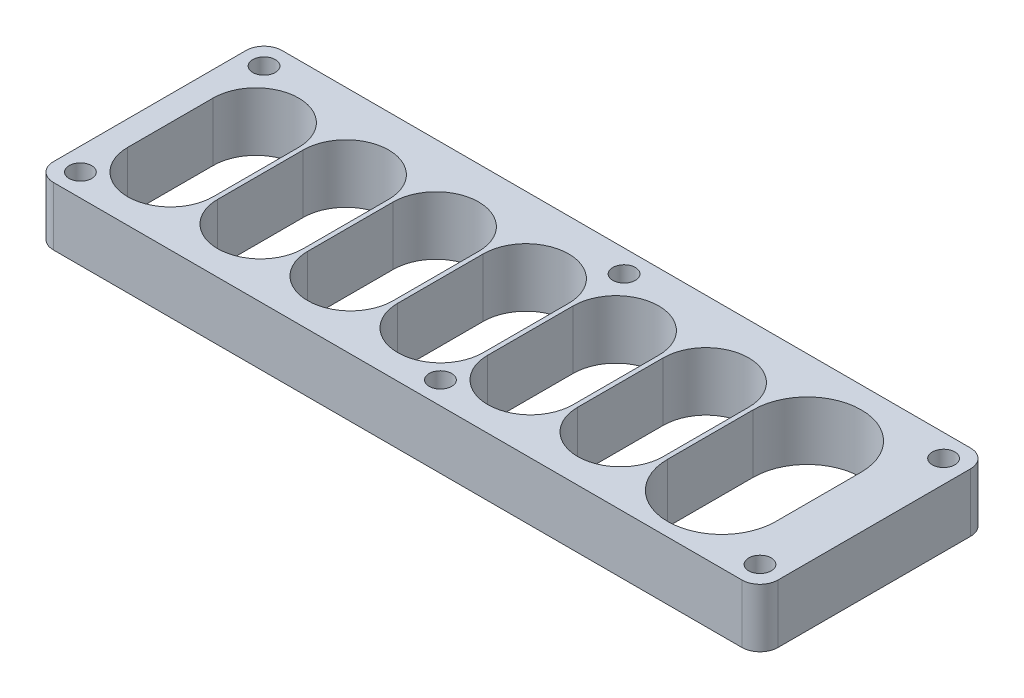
ISO-10303-21;
HEADER;
FILE_DESCRIPTION(('STEP AP214'),'2;1');
FILE_NAME('part.step','',(''),(''),'','','');
FILE_SCHEMA(('AUTOMOTIVE_DESIGN { 1 0 10303 214 1 1 1 1 }'));
ENDSEC;
DATA;
#1=APPLICATION_CONTEXT('core data for automotive mechanical design processes');
#2=APPLICATION_PROTOCOL_DEFINITION('international standard','automotive_design',2000,#1);
#3=PRODUCT_CONTEXT('',#1,'mechanical');
#4=PRODUCT('Part','Part','',(#3));
#5=PRODUCT_RELATED_PRODUCT_CATEGORY('part','',(#4));
#6=PRODUCT_DEFINITION_FORMATION('','',#4);
#7=PRODUCT_DEFINITION_CONTEXT('part definition',#1,'design');
#8=PRODUCT_DEFINITION('design','',#6,#7);
#9=PRODUCT_DEFINITION_SHAPE('','',#8);
#10=(LENGTH_UNIT() NAMED_UNIT(*) SI_UNIT(.MILLI.,.METRE.));
#11=(NAMED_UNIT(*) PLANE_ANGLE_UNIT() SI_UNIT($,.RADIAN.));
#12=(NAMED_UNIT(*) SI_UNIT($,.STERADIAN.) SOLID_ANGLE_UNIT());
#13=UNCERTAINTY_MEASURE_WITH_UNIT(LENGTH_MEASURE(1.E-05),#10,'distance_accuracy_value','');
#14=(GEOMETRIC_REPRESENTATION_CONTEXT(3) GLOBAL_UNCERTAINTY_ASSIGNED_CONTEXT((#13)) GLOBAL_UNIT_ASSIGNED_CONTEXT((#10,
#11,#12)) REPRESENTATION_CONTEXT('',''));
#15=CARTESIAN_POINT('',(0.,0.,0.));
#16=DIRECTION('',(0.,0.,1.));
#17=DIRECTION('',(1.,0.,0.));
#18=AXIS2_PLACEMENT_3D('',#15,#16,#17);
#19=CARTESIAN_POINT('',(0.,0.,0.));
#20=DIRECTION('',(0.,1.,0.));
#21=DIRECTION('',(0.,0.,1.));
#22=AXIS2_PLACEMENT_3D('',#19,#20,#21);
#23=PLANE('',#22);
#24=CARTESIAN_POINT('',(-156.,0.,45.8));
#25=DIRECTION('',(0.,-1.,0.));
#26=DIRECTION('',(0.,0.,-1.));
#27=AXIS2_PLACEMENT_3D('',#24,#25,#26);
#28=CIRCLE('',#27,4.49999999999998);
#29=CARTESIAN_POINT('',(-156.,0.,41.3));
#30=VERTEX_POINT('',#29);
#31=EDGE_CURVE('E889',#30,#30,#28,.T.);
#32=ORIENTED_EDGE('',*,*,#31,.F.);
#33=EDGE_LOOP('',(#32));
#34=FACE_BOUND('',#33,.T.);
#35=CARTESIAN_POINT('',(-76.,0.,45.8));
#36=DIRECTION('',(0.,-1.,0.));
#37=DIRECTION('',(0.,0.,-1.));
#38=AXIS2_PLACEMENT_3D('',#35,#36,#37);
#39=CIRCLE('',#38,4.49999999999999);
#40=CARTESIAN_POINT('',(-76.,0.,41.3));
#41=VERTEX_POINT('',#40);
#42=EDGE_CURVE('E586',#41,#41,#39,.T.);
#43=ORIENTED_EDGE('',*,*,#42,.F.);
#44=EDGE_LOOP('',(#43));
#45=FACE_BOUND('',#44,.T.);
#46=CARTESIAN_POINT('',(-5.,0.,5.));
#47=DIRECTION('',(0.,-1.,0.));
#48=DIRECTION('',(0.,0.,-1.));
#49=AXIS2_PLACEMENT_3D('',#46,#47,#48);
#50=CIRCLE('',#49,4.49999999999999);
#51=CARTESIAN_POINT('',(-5.,0.,0.50000000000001));
#52=VERTEX_POINT('',#51);
#53=EDGE_CURVE('E575',#52,#52,#50,.T.);
#54=ORIENTED_EDGE('',*,*,#53,.F.);
#55=EDGE_LOOP('',(#54));
#56=FACE_BOUND('',#55,.T.);
#57=CARTESIAN_POINT('',(-76.,0.,5.));
#58=DIRECTION('',(0.,-1.,0.));
#59=DIRECTION('',(0.,0.,-1.));
#60=AXIS2_PLACEMENT_3D('',#57,#58,#59);
#61=CIRCLE('',#60,4.49999999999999);
#62=CARTESIAN_POINT('',(-76.,0.,0.50000000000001));
#63=VERTEX_POINT('',#62);
#64=EDGE_CURVE('E571',#63,#63,#61,.T.);
#65=ORIENTED_EDGE('',*,*,#64,.F.);
#66=EDGE_LOOP('',(#65));
#67=FACE_BOUND('',#66,.T.);
#68=DIRECTION('',(0.,0.,1.));
#69=VECTOR('',#68,1.);
#70=CARTESIAN_POINT('',(-161.,0.,0.));
#71=LINE('',#70,#69);
#72=CARTESIAN_POINT('',(-161.,0.,4.));
#73=VERTEX_POINT('',#72);
#74=CARTESIAN_POINT('',(-161.,0.,46.8));
#75=VERTEX_POINT('',#74);
#76=EDGE_CURVE('E499',#73,#75,#71,.T.);
#77=ORIENTED_EDGE('',*,*,#76,.F.);
#78=CARTESIAN_POINT('',(-157.,0.,4.));
#79=DIRECTION('',(0.,1.,0.));
#80=DIRECTION('',(0.,0.,1.));
#81=AXIS2_PLACEMENT_3D('',#78,#79,#80);
#82=CIRCLE('',#81,4.);
#83=CARTESIAN_POINT('',(-157.,0.,0.));
#84=VERTEX_POINT('',#83);
#85=EDGE_CURVE('E537',#73,#84,#82,.F.);
#86=ORIENTED_EDGE('',*,*,#85,.T.);
#87=DIRECTION('',(-1.,0.,0.));
#88=VECTOR('',#87,1.);
#89=CARTESIAN_POINT('',(-161.,0.,0.));
#90=LINE('',#89,#88);
#91=CARTESIAN_POINT('',(-4.,0.,0.));
#92=VERTEX_POINT('',#91);
#93=EDGE_CURVE('E510',#92,#84,#90,.T.);
#94=ORIENTED_EDGE('',*,*,#93,.F.);
#95=CARTESIAN_POINT('',(-4.,0.,4.));
#96=DIRECTION('',(0.,1.,0.));
#97=DIRECTION('',(0.,0.,1.));
#98=AXIS2_PLACEMENT_3D('',#95,#96,#97);
#99=CIRCLE('',#98,4.);
#100=CARTESIAN_POINT('',(0.,0.,4.));
#101=VERTEX_POINT('',#100);
#102=EDGE_CURVE('E533',#92,#101,#99,.F.);
#103=ORIENTED_EDGE('',*,*,#102,.T.);
#104=DIRECTION('',(0.,0.,-1.));
#105=VECTOR('',#104,1.);
#106=CARTESIAN_POINT('',(0.,0.,0.));
#107=LINE('',#106,#105);
#108=CARTESIAN_POINT('',(0.,0.,46.8));
#109=VERTEX_POINT('',#108);
#110=EDGE_CURVE('E523',#109,#101,#107,.T.);
#111=ORIENTED_EDGE('',*,*,#110,.F.);
#112=CARTESIAN_POINT('',(-4.,0.,46.8));
#113=DIRECTION('',(0.,1.,0.));
#114=DIRECTION('',(0.,0.,1.));
#115=AXIS2_PLACEMENT_3D('',#112,#113,#114);
#116=CIRCLE('',#115,4.);
#117=CARTESIAN_POINT('',(-4.,0.,50.8));
#118=VERTEX_POINT('',#117);
#119=EDGE_CURVE('E531',#109,#118,#116,.F.);
#120=ORIENTED_EDGE('',*,*,#119,.T.);
#121=DIRECTION('',(1.,0.,0.));
#122=VECTOR('',#121,1.);
#123=CARTESIAN_POINT('',(-161.,0.,50.8));
#124=LINE('',#123,#122);
#125=CARTESIAN_POINT('',(-157.,0.,50.8));
#126=VERTEX_POINT('',#125);
#127=EDGE_CURVE('E520',#126,#118,#124,.T.);
#128=ORIENTED_EDGE('',*,*,#127,.F.);
#129=CARTESIAN_POINT('',(-157.,0.,46.8));
#130=DIRECTION('',(0.,1.,0.));
#131=DIRECTION('',(0.,0.,1.));
#132=AXIS2_PLACEMENT_3D('',#129,#130,#131);
#133=CIRCLE('',#132,4.);
#134=EDGE_CURVE('E535',#126,#75,#133,.F.);
#135=ORIENTED_EDGE('',*,*,#134,.T.);
#136=EDGE_LOOP('',(#77,#86,#94,#103,#111,#120,#128,#135));
#137=FACE_BOUND('',#136,.T.);
#138=DIRECTION('',(0.,0.,-1.));
#139=VECTOR('',#138,1.);
#140=CARTESIAN_POINT('',(-136.5,0.,16.8));
#141=LINE('',#140,#139);
#142=CARTESIAN_POINT('',(-136.5,0.,35.8));
#143=VERTEX_POINT('',#142);
#144=CARTESIAN_POINT('',(-136.5,0.,16.8));
#145=VERTEX_POINT('',#144);
#146=EDGE_CURVE('E484',#143,#145,#141,.T.);
#147=ORIENTED_EDGE('',*,*,#146,.T.);
#148=CARTESIAN_POINT('',(-146.,0.,16.8));
#149=DIRECTION('',(0.,1.,0.));
#150=DIRECTION('',(0.,0.,1.));
#151=AXIS2_PLACEMENT_3D('',#148,#149,#150);
#152=CIRCLE('',#151,9.49999999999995);
#153=CARTESIAN_POINT('',(-155.5,0.,16.8));
#154=VERTEX_POINT('',#153);
#155=EDGE_CURVE('E474',#145,#154,#152,.T.);
#156=ORIENTED_EDGE('',*,*,#155,.T.);
#157=DIRECTION('',(0.,0.,1.));
#158=VECTOR('',#157,1.);
#159=CARTESIAN_POINT('',(-155.5,0.,16.8));
#160=LINE('',#159,#158);
#161=CARTESIAN_POINT('',(-155.5,0.,35.8));
#162=VERTEX_POINT('',#161);
#163=EDGE_CURVE('E477',#154,#162,#160,.T.);
#164=ORIENTED_EDGE('',*,*,#163,.T.);
#165=CARTESIAN_POINT('',(-146.,0.,35.8));
#166=DIRECTION('',(0.,1.,0.));
#167=DIRECTION('',(0.,0.,1.));
#168=AXIS2_PLACEMENT_3D('',#165,#166,#167);
#169=CIRCLE('',#168,9.49999999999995);
#170=EDGE_CURVE('E481',#162,#143,#169,.T.);
#171=ORIENTED_EDGE('',*,*,#170,.T.);
#172=EDGE_LOOP('',(#147,#156,#164,#171));
#173=FACE_BOUND('',#172,.T.);
#174=DIRECTION('',(0.,0.,-1.));
#175=VECTOR('',#174,1.);
#176=CARTESIAN_POINT('',(-116.5,0.,16.8));
#177=LINE('',#176,#175);
#178=CARTESIAN_POINT('',(-116.5,0.,35.8));
#179=VERTEX_POINT('',#178);
#180=CARTESIAN_POINT('',(-116.5,0.,16.8));
#181=VERTEX_POINT('',#180);
#182=EDGE_CURVE('E452',#179,#181,#177,.T.);
#183=ORIENTED_EDGE('',*,*,#182,.T.);
#184=CARTESIAN_POINT('',(-126.,0.,16.8));
#185=DIRECTION('',(0.,1.,0.));
#186=DIRECTION('',(0.,0.,1.));
#187=AXIS2_PLACEMENT_3D('',#184,#185,#186);
#188=CIRCLE('',#187,9.49999999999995);
#189=CARTESIAN_POINT('',(-135.5,0.,16.8));
#190=VERTEX_POINT('',#189);
#191=EDGE_CURVE('E442',#181,#190,#188,.T.);
#192=ORIENTED_EDGE('',*,*,#191,.T.);
#193=DIRECTION('',(0.,0.,1.));
#194=VECTOR('',#193,1.);
#195=CARTESIAN_POINT('',(-135.5,0.,16.8));
#196=LINE('',#195,#194);
#197=CARTESIAN_POINT('',(-135.5,0.,35.8));
#198=VERTEX_POINT('',#197);
#199=EDGE_CURVE('E445',#190,#198,#196,.T.);
#200=ORIENTED_EDGE('',*,*,#199,.T.);
#201=CARTESIAN_POINT('',(-126.,0.,35.8));
#202=DIRECTION('',(0.,1.,0.));
#203=DIRECTION('',(0.,0.,1.));
#204=AXIS2_PLACEMENT_3D('',#201,#202,#203);
#205=CIRCLE('',#204,9.49999999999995);
#206=EDGE_CURVE('E449',#198,#179,#205,.T.);
#207=ORIENTED_EDGE('',*,*,#206,.T.);
#208=EDGE_LOOP('',(#183,#192,#200,#207));
#209=FACE_BOUND('',#208,.T.);
#210=DIRECTION('',(0.,0.,-1.));
#211=VECTOR('',#210,1.);
#212=CARTESIAN_POINT('',(-96.5000000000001,0.,16.8));
#213=LINE('',#212,#211);
#214=CARTESIAN_POINT('',(-96.5000000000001,0.,35.8));
#215=VERTEX_POINT('',#214);
#216=CARTESIAN_POINT('',(-96.5000000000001,0.,16.8));
#217=VERTEX_POINT('',#216);
#218=EDGE_CURVE('E420',#215,#217,#213,.T.);
#219=ORIENTED_EDGE('',*,*,#218,.T.);
#220=CARTESIAN_POINT('',(-106.,0.,16.8));
#221=DIRECTION('',(0.,1.,0.));
#222=DIRECTION('',(0.,0.,1.));
#223=AXIS2_PLACEMENT_3D('',#220,#221,#222);
#224=CIRCLE('',#223,9.49999999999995);
#225=CARTESIAN_POINT('',(-115.5,0.,16.8));
#226=VERTEX_POINT('',#225);
#227=EDGE_CURVE('E410',#217,#226,#224,.T.);
#228=ORIENTED_EDGE('',*,*,#227,.T.);
#229=DIRECTION('',(0.,0.,1.));
#230=VECTOR('',#229,1.);
#231=CARTESIAN_POINT('',(-115.5,0.,16.8));
#232=LINE('',#231,#230);
#233=CARTESIAN_POINT('',(-115.5,0.,35.8));
#234=VERTEX_POINT('',#233);
#235=EDGE_CURVE('E413',#226,#234,#232,.T.);
#236=ORIENTED_EDGE('',*,*,#235,.T.);
#237=CARTESIAN_POINT('',(-106.,0.,35.8));
#238=DIRECTION('',(0.,1.,0.));
#239=DIRECTION('',(0.,0.,1.));
#240=AXIS2_PLACEMENT_3D('',#237,#238,#239);
#241=CIRCLE('',#240,9.49999999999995);
#242=EDGE_CURVE('E417',#234,#215,#241,.T.);
#243=ORIENTED_EDGE('',*,*,#242,.T.);
#244=EDGE_LOOP('',(#219,#228,#236,#243));
#245=FACE_BOUND('',#244,.T.);
#246=DIRECTION('',(0.,0.,-1.));
#247=VECTOR('',#246,1.);
#248=CARTESIAN_POINT('',(-76.5000000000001,0.,16.8));
#249=LINE('',#248,#247);
#250=CARTESIAN_POINT('',(-76.5000000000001,0.,35.8));
#251=VERTEX_POINT('',#250);
#252=CARTESIAN_POINT('',(-76.5000000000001,0.,16.8));
#253=VERTEX_POINT('',#252);
#254=EDGE_CURVE('E388',#251,#253,#249,.T.);
#255=ORIENTED_EDGE('',*,*,#254,.T.);
#256=CARTESIAN_POINT('',(-86.,0.,16.8));
#257=DIRECTION('',(0.,1.,0.));
#258=DIRECTION('',(0.,0.,1.));
#259=AXIS2_PLACEMENT_3D('',#256,#257,#258);
#260=CIRCLE('',#259,9.49999999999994);
#261=CARTESIAN_POINT('',(-95.4999999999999,0.,16.8));
#262=VERTEX_POINT('',#261);
#263=EDGE_CURVE('E378',#253,#262,#260,.T.);
#264=ORIENTED_EDGE('',*,*,#263,.T.);
#265=DIRECTION('',(0.,0.,1.));
#266=VECTOR('',#265,1.);
#267=CARTESIAN_POINT('',(-95.4999999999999,0.,16.8));
#268=LINE('',#267,#266);
#269=CARTESIAN_POINT('',(-95.4999999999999,0.,35.8));
#270=VERTEX_POINT('',#269);
#271=EDGE_CURVE('E381',#262,#270,#268,.T.);
#272=ORIENTED_EDGE('',*,*,#271,.T.);
#273=CARTESIAN_POINT('',(-86.,0.,35.8));
#274=DIRECTION('',(0.,1.,0.));
#275=DIRECTION('',(0.,0.,1.));
#276=AXIS2_PLACEMENT_3D('',#273,#274,#275);
#277=CIRCLE('',#276,9.49999999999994);
#278=EDGE_CURVE('E385',#270,#251,#277,.T.);
#279=ORIENTED_EDGE('',*,*,#278,.T.);
#280=EDGE_LOOP('',(#255,#264,#272,#279));
#281=FACE_BOUND('',#280,.T.);
#282=DIRECTION('',(0.,0.,-1.));
#283=VECTOR('',#282,1.);
#284=CARTESIAN_POINT('',(-56.5000000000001,0.,16.8));
#285=LINE('',#284,#283);
#286=CARTESIAN_POINT('',(-56.5,0.,35.8));
#287=VERTEX_POINT('',#286);
#288=CARTESIAN_POINT('',(-56.5000000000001,0.,16.8));
#289=VERTEX_POINT('',#288);
#290=EDGE_CURVE('E356',#287,#289,#285,.T.);
#291=ORIENTED_EDGE('',*,*,#290,.T.);
#292=CARTESIAN_POINT('',(-66.,0.,16.8));
#293=DIRECTION('',(0.,1.,0.));
#294=DIRECTION('',(0.,0.,1.));
#295=AXIS2_PLACEMENT_3D('',#292,#293,#294);
#296=CIRCLE('',#295,9.49999999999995);
#297=CARTESIAN_POINT('',(-75.5,0.,16.8));
#298=VERTEX_POINT('',#297);
#299=EDGE_CURVE('E346',#289,#298,#296,.T.);
#300=ORIENTED_EDGE('',*,*,#299,.T.);
#301=DIRECTION('',(0.,0.,1.));
#302=VECTOR('',#301,1.);
#303=CARTESIAN_POINT('',(-75.5,0.,16.8));
#304=LINE('',#303,#302);
#305=CARTESIAN_POINT('',(-75.5,0.,35.8));
#306=VERTEX_POINT('',#305);
#307=EDGE_CURVE('E349',#298,#306,#304,.T.);
#308=ORIENTED_EDGE('',*,*,#307,.T.);
#309=CARTESIAN_POINT('',(-66.,0.,35.8));
#310=DIRECTION('',(0.,1.,0.));
#311=DIRECTION('',(0.,0.,1.));
#312=AXIS2_PLACEMENT_3D('',#309,#310,#311);
#313=CIRCLE('',#312,9.49999999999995);
#314=EDGE_CURVE('E353',#306,#287,#313,.T.);
#315=ORIENTED_EDGE('',*,*,#314,.T.);
#316=EDGE_LOOP('',(#291,#300,#308,#315));
#317=FACE_BOUND('',#316,.T.);
#318=DIRECTION('',(0.,0.,-1.));
#319=VECTOR('',#318,1.);
#320=CARTESIAN_POINT('',(-36.5,0.,16.8));
#321=LINE('',#320,#319);
#322=CARTESIAN_POINT('',(-36.5,0.,35.8));
#323=VERTEX_POINT('',#322);
#324=CARTESIAN_POINT('',(-36.5,0.,16.8));
#325=VERTEX_POINT('',#324);
#326=EDGE_CURVE('E324',#323,#325,#321,.T.);
#327=ORIENTED_EDGE('',*,*,#326,.T.);
#328=CARTESIAN_POINT('',(-46.,0.,16.8));
#329=DIRECTION('',(0.,1.,0.));
#330=DIRECTION('',(0.,0.,1.));
#331=AXIS2_PLACEMENT_3D('',#328,#329,#330);
#332=CIRCLE('',#331,9.49999999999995);
#333=CARTESIAN_POINT('',(-55.5,0.,16.8));
#334=VERTEX_POINT('',#333);
#335=EDGE_CURVE('E314',#325,#334,#332,.T.);
#336=ORIENTED_EDGE('',*,*,#335,.T.);
#337=DIRECTION('',(0.,0.,1.));
#338=VECTOR('',#337,1.);
#339=CARTESIAN_POINT('',(-55.5,0.,16.8));
#340=LINE('',#339,#338);
#341=CARTESIAN_POINT('',(-55.5,0.,35.8));
#342=VERTEX_POINT('',#341);
#343=EDGE_CURVE('E317',#334,#342,#340,.T.);
#344=ORIENTED_EDGE('',*,*,#343,.T.);
#345=CARTESIAN_POINT('',(-46.,0.,35.8));
#346=DIRECTION('',(0.,1.,0.));
#347=DIRECTION('',(0.,0.,1.));
#348=AXIS2_PLACEMENT_3D('',#345,#346,#347);
#349=CIRCLE('',#348,9.49999999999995);
#350=EDGE_CURVE('E321',#342,#323,#349,.T.);
#351=ORIENTED_EDGE('',*,*,#350,.T.);
#352=EDGE_LOOP('',(#327,#336,#344,#351));
#353=FACE_BOUND('',#352,.T.);
#354=DIRECTION('',(0.,0.,-1.));
#355=VECTOR('',#354,1.);
#356=CARTESIAN_POINT('',(-11.5,0.,16.8));
#357=LINE('',#356,#355);
#358=CARTESIAN_POINT('',(-11.5,0.,35.8));
#359=VERTEX_POINT('',#358);
#360=CARTESIAN_POINT('',(-11.5,0.,16.8));
#361=VERTEX_POINT('',#360);
#362=EDGE_CURVE('E280',#359,#361,#357,.T.);
#363=ORIENTED_EDGE('',*,*,#362,.T.);
#364=CARTESIAN_POINT('',(-23.5,0.,16.8));
#365=DIRECTION('',(0.,1.,0.));
#366=DIRECTION('',(0.,0.,1.));
#367=AXIS2_PLACEMENT_3D('',#364,#365,#366);
#368=CIRCLE('',#367,12.);
#369=CARTESIAN_POINT('',(-35.5,0.,16.8));
#370=VERTEX_POINT('',#369);
#371=EDGE_CURVE('E272',#361,#370,#368,.T.);
#372=ORIENTED_EDGE('',*,*,#371,.T.);
#373=DIRECTION('',(0.,0.,1.));
#374=VECTOR('',#373,1.);
#375=CARTESIAN_POINT('',(-35.5,0.,16.8));
#376=LINE('',#375,#374);
#377=CARTESIAN_POINT('',(-35.5,0.,35.8));
#378=VERTEX_POINT('',#377);
#379=EDGE_CURVE('E284',#370,#378,#376,.T.);
#380=ORIENTED_EDGE('',*,*,#379,.T.);
#381=CARTESIAN_POINT('',(-23.5,0.,35.8));
#382=DIRECTION('',(0.,1.,0.));
#383=DIRECTION('',(0.,0.,1.));
#384=AXIS2_PLACEMENT_3D('',#381,#382,#383);
#385=CIRCLE('',#384,12.);
#386=EDGE_CURVE('E288',#378,#359,#385,.T.);
#387=ORIENTED_EDGE('',*,*,#386,.T.);
#388=EDGE_LOOP('',(#363,#372,#380,#387));
#389=FACE_BOUND('',#388,.T.);
#390=CARTESIAN_POINT('',(-156.,0.,5.));
#391=DIRECTION('',(0.,-1.,0.));
#392=DIRECTION('',(0.,0.,-1.));
#393=AXIS2_PLACEMENT_3D('',#390,#391,#392);
#394=CIRCLE('',#393,4.49999999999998);
#395=CARTESIAN_POINT('',(-156.,0.,0.500000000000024));
#396=VERTEX_POINT('',#395);
#397=EDGE_CURVE('E566',#396,#396,#394,.T.);
#398=ORIENTED_EDGE('',*,*,#397,.F.);
#399=EDGE_LOOP('',(#398));
#400=FACE_BOUND('',#399,.T.);
#401=CARTESIAN_POINT('',(-5.,0.,45.8));
#402=DIRECTION('',(0.,-1.,0.));
#403=DIRECTION('',(0.,0.,-1.));
#404=AXIS2_PLACEMENT_3D('',#401,#402,#403);
#405=CIRCLE('',#404,4.49999999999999);
#406=CARTESIAN_POINT('',(-5.,0.,41.3));
#407=VERTEX_POINT('',#406);
#408=EDGE_CURVE('E579',#407,#407,#405,.T.);
#409=ORIENTED_EDGE('',*,*,#408,.F.);
#410=EDGE_LOOP('',(#409));
#411=FACE_BOUND('',#410,.T.);
#412=ADVANCED_FACE('F33',(#34,#45,#56,#67,#137,#173,#209,#245,#281,#317,#353,#389,#400,#411),
#23,.F.);
#413=CARTESIAN_POINT('',(-161.,13.,0.));
#414=DIRECTION('',(1.,0.,0.));
#415=DIRECTION('',(0.,0.,-1.));
#416=AXIS2_PLACEMENT_3D('',#413,#414,#415);
#417=PLANE('',#416);
#418=DIRECTION('',(0.,0.,1.));
#419=VECTOR('',#418,1.);
#420=CARTESIAN_POINT('',(-161.,13.,0.));
#421=LINE('',#420,#419);
#422=CARTESIAN_POINT('',(-161.,13.,4.));
#423=VERTEX_POINT('',#422);
#424=CARTESIAN_POINT('',(-161.,13.,46.8));
#425=VERTEX_POINT('',#424);
#426=EDGE_CURVE('E506',#423,#425,#421,.T.);
#427=ORIENTED_EDGE('',*,*,#426,.F.);
#428=DIRECTION('',(0.,-1.,0.));
#429=VECTOR('',#428,1.);
#430=CARTESIAN_POINT('',(-161.,13.,4.));
#431=LINE('',#430,#429);
#432=EDGE_CURVE('E528',#423,#73,#431,.T.);
#433=ORIENTED_EDGE('',*,*,#432,.T.);
#434=ORIENTED_EDGE('',*,*,#76,.T.);
#435=DIRECTION('',(0.,-1.,0.));
#436=VECTOR('',#435,1.);
#437=CARTESIAN_POINT('',(-161.,13.,46.8));
#438=LINE('',#437,#436);
#439=EDGE_CURVE('E517',#75,#425,#438,.F.);
#440=ORIENTED_EDGE('',*,*,#439,.T.);
#441=EDGE_LOOP('',(#427,#433,#434,#440));
#442=FACE_BOUND('',#441,.T.);
#443=ADVANCED_FACE('F671',(#442),#417,.F.);
#444=CARTESIAN_POINT('',(-161.,13.,50.8));
#445=DIRECTION('',(0.,0.,-1.));
#446=DIRECTION('',(-1.,0.,0.));
#447=AXIS2_PLACEMENT_3D('',#444,#445,#446);
#448=PLANE('',#447);
#449=DIRECTION('',(1.,0.,0.));
#450=VECTOR('',#449,1.);
#451=CARTESIAN_POINT('',(-161.,13.,50.8));
#452=LINE('',#451,#450);
#453=CARTESIAN_POINT('',(-157.,13.,50.8));
#454=VERTEX_POINT('',#453);
#455=CARTESIAN_POINT('',(-4.,13.,50.8));
#456=VERTEX_POINT('',#455);
#457=EDGE_CURVE('E509',#454,#456,#452,.T.);
#458=ORIENTED_EDGE('',*,*,#457,.F.);
#459=DIRECTION('',(0.,-1.,0.));
#460=VECTOR('',#459,1.);
#461=CARTESIAN_POINT('',(-157.,13.,50.8));
#462=LINE('',#461,#460);
#463=EDGE_CURVE('E553',#454,#126,#462,.T.);
#464=ORIENTED_EDGE('',*,*,#463,.T.);
#465=ORIENTED_EDGE('',*,*,#127,.T.);
#466=DIRECTION('',(0.,-1.,0.));
#467=VECTOR('',#466,1.);
#468=CARTESIAN_POINT('',(-4.,13.,50.8));
#469=LINE('',#468,#467);
#470=EDGE_CURVE('E551',#118,#456,#469,.F.);
#471=ORIENTED_EDGE('',*,*,#470,.T.);
#472=EDGE_LOOP('',(#458,#464,#465,#471));
#473=FACE_BOUND('',#472,.T.);
#474=ADVANCED_FACE('F683',(#473),#448,.F.);
#475=CARTESIAN_POINT('',(0.,13.,0.));
#476=DIRECTION('',(-1.,0.,0.));
#477=DIRECTION('',(0.,0.,1.));
#478=AXIS2_PLACEMENT_3D('',#475,#476,#477);
#479=PLANE('',#478);
#480=ORIENTED_EDGE('',*,*,#110,.T.);
#481=DIRECTION('',(0.,-1.,0.));
#482=VECTOR('',#481,1.);
#483=CARTESIAN_POINT('',(0.,13.,4.));
#484=LINE('',#483,#482);
#485=CARTESIAN_POINT('',(0.,13.,4.));
#486=VERTEX_POINT('',#485);
#487=EDGE_CURVE('E11',#101,#486,#484,.F.);
#488=ORIENTED_EDGE('',*,*,#487,.T.);
#489=DIRECTION('',(0.,0.,-1.));
#490=VECTOR('',#489,1.);
#491=CARTESIAN_POINT('',(0.,13.,0.));
#492=LINE('',#491,#490);
#493=CARTESIAN_POINT('',(0.,13.,46.8));
#494=VERTEX_POINT('',#493);
#495=EDGE_CURVE('E512',#494,#486,#492,.T.);
#496=ORIENTED_EDGE('',*,*,#495,.F.);
#497=DIRECTION('',(0.,-1.,0.));
#498=VECTOR('',#497,1.);
#499=CARTESIAN_POINT('',(0.,13.,46.8));
#500=LINE('',#499,#498);
#501=EDGE_CURVE('E42',#494,#109,#500,.T.);
#502=ORIENTED_EDGE('',*,*,#501,.T.);
#503=EDGE_LOOP('',(#480,#488,#496,#502));
#504=FACE_BOUND('',#503,.T.);
#505=ADVANCED_FACE('F688',(#504),#479,.F.);
#506=CARTESIAN_POINT('',(-161.,13.,0.));
#507=DIRECTION('',(0.,0.,1.));
#508=DIRECTION('',(1.,0.,0.));
#509=AXIS2_PLACEMENT_3D('',#506,#507,#508);
#510=PLANE('',#509);
#511=ORIENTED_EDGE('',*,*,#93,.T.);
#512=DIRECTION('',(0.,-1.,0.));
#513=VECTOR('',#512,1.);
#514=CARTESIAN_POINT('',(-157.,13.,0.));
#515=LINE('',#514,#513);
#516=CARTESIAN_POINT('',(-157.,13.,0.));
#517=VERTEX_POINT('',#516);
#518=EDGE_CURVE('E542',#84,#517,#515,.F.);
#519=ORIENTED_EDGE('',*,*,#518,.T.);
#520=DIRECTION('',(-1.,0.,0.));
#521=VECTOR('',#520,1.);
#522=CARTESIAN_POINT('',(-161.,13.,0.));
#523=LINE('',#522,#521);
#524=CARTESIAN_POINT('',(-4.,13.,0.));
#525=VERTEX_POINT('',#524);
#526=EDGE_CURVE('E514',#525,#517,#523,.T.);
#527=ORIENTED_EDGE('',*,*,#526,.F.);
#528=DIRECTION('',(0.,-1.,0.));
#529=VECTOR('',#528,1.);
#530=CARTESIAN_POINT('',(-4.,13.,0.));
#531=LINE('',#530,#529);
#532=EDGE_CURVE('E539',#525,#92,#531,.T.);
#533=ORIENTED_EDGE('',*,*,#532,.T.);
#534=EDGE_LOOP('',(#511,#519,#527,#533));
#535=FACE_BOUND('',#534,.T.);
#536=ADVANCED_FACE('F631',(#535),#510,.F.);
#537=CARTESIAN_POINT('',(0.,13.,0.));
#538=DIRECTION('',(0.,1.,0.));
#539=DIRECTION('',(0.,0.,1.));
#540=AXIS2_PLACEMENT_3D('',#537,#538,#539);
#541=PLANE('',#540);
#542=CARTESIAN_POINT('',(-156.,13.,45.8));
#543=DIRECTION('',(0.,1.,0.));
#544=DIRECTION('',(0.,0.,1.));
#545=AXIS2_PLACEMENT_3D('',#542,#543,#544);
#546=CIRCLE('',#545,2.5);
#547=CARTESIAN_POINT('',(-156.,13.,48.3));
#548=VERTEX_POINT('',#547);
#549=EDGE_CURVE('E561',#548,#548,#546,.T.);
#550=ORIENTED_EDGE('',*,*,#549,.F.);
#551=EDGE_LOOP('',(#550));
#552=FACE_BOUND('',#551,.T.);
#553=CARTESIAN_POINT('',(-76.,13.,45.8));
#554=DIRECTION('',(0.,1.,0.));
#555=DIRECTION('',(0.,0.,1.));
#556=AXIS2_PLACEMENT_3D('',#553,#554,#555);
#557=CIRCLE('',#556,2.5);
#558=CARTESIAN_POINT('',(-76.,13.,48.3));
#559=VERTEX_POINT('',#558);
#560=EDGE_CURVE('E610',#559,#559,#557,.T.);
#561=ORIENTED_EDGE('',*,*,#560,.F.);
#562=EDGE_LOOP('',(#561));
#563=FACE_BOUND('',#562,.T.);
#564=CARTESIAN_POINT('',(-5.,13.,45.8));
#565=DIRECTION('',(0.,1.,0.));
#566=DIRECTION('',(0.,0.,1.));
#567=AXIS2_PLACEMENT_3D('',#564,#565,#566);
#568=CIRCLE('',#567,2.5);
#569=CARTESIAN_POINT('',(-5.,13.,48.3));
#570=VERTEX_POINT('',#569);
#571=EDGE_CURVE('E613',#570,#570,#568,.T.);
#572=ORIENTED_EDGE('',*,*,#571,.F.);
#573=EDGE_LOOP('',(#572));
#574=FACE_BOUND('',#573,.T.);
#575=CARTESIAN_POINT('',(-5.,13.,5.));
#576=DIRECTION('',(0.,1.,0.));
#577=DIRECTION('',(0.,0.,1.));
#578=AXIS2_PLACEMENT_3D('',#575,#576,#577);
#579=CIRCLE('',#578,2.5);
#580=CARTESIAN_POINT('',(-5.,13.,7.5));
#581=VERTEX_POINT('',#580);
#582=EDGE_CURVE('E616',#581,#581,#579,.T.);
#583=ORIENTED_EDGE('',*,*,#582,.F.);
#584=EDGE_LOOP('',(#583));
#585=FACE_BOUND('',#584,.T.);
#586=CARTESIAN_POINT('',(-76.,13.,5.));
#587=DIRECTION('',(0.,1.,0.));
#588=DIRECTION('',(0.,0.,1.));
#589=AXIS2_PLACEMENT_3D('',#586,#587,#588);
#590=CIRCLE('',#589,2.5);
#591=CARTESIAN_POINT('',(-76.,13.,7.5));
#592=VERTEX_POINT('',#591);
#593=EDGE_CURVE('E618',#592,#592,#590,.T.);
#594=ORIENTED_EDGE('',*,*,#593,.F.);
#595=EDGE_LOOP('',(#594));
#596=FACE_BOUND('',#595,.T.);
#597=CARTESIAN_POINT('',(-156.,13.,5.));
#598=DIRECTION('',(0.,1.,0.));
#599=DIRECTION('',(0.,0.,1.));
#600=AXIS2_PLACEMENT_3D('',#597,#598,#599);
#601=CIRCLE('',#600,2.5);
#602=CARTESIAN_POINT('',(-156.,13.,7.5));
#603=VERTEX_POINT('',#602);
#604=EDGE_CURVE('E298',#603,#603,#601,.T.);
#605=ORIENTED_EDGE('',*,*,#604,.F.);
#606=EDGE_LOOP('',(#605));
#607=FACE_BOUND('',#606,.T.);
#608=CARTESIAN_POINT('',(-23.5,13.,16.8));
#609=DIRECTION('',(0.,1.,0.));
#610=DIRECTION('',(0.,0.,1.));
#611=AXIS2_PLACEMENT_3D('',#608,#609,#610);
#612=CIRCLE('',#611,12.);
#613=CARTESIAN_POINT('',(-11.5,13.,16.8));
#614=VERTEX_POINT('',#613);
#615=CARTESIAN_POINT('',(-35.5,13.,16.8));
#616=VERTEX_POINT('',#615);
#617=EDGE_CURVE('E275',#614,#616,#612,.T.);
#618=ORIENTED_EDGE('',*,*,#617,.F.);
#619=DIRECTION('',(0.,0.,-1.));
#620=VECTOR('',#619,1.);
#621=CARTESIAN_POINT('',(-11.5,13.,16.8));
#622=LINE('',#621,#620);
#623=CARTESIAN_POINT('',(-11.5,13.,35.8));
#624=VERTEX_POINT('',#623);
#625=EDGE_CURVE('E292',#624,#614,#622,.T.);
#626=ORIENTED_EDGE('',*,*,#625,.F.);
#627=CARTESIAN_POINT('',(-23.5,13.,35.8));
#628=DIRECTION('',(0.,1.,0.));
#629=DIRECTION('',(0.,0.,1.));
#630=AXIS2_PLACEMENT_3D('',#627,#628,#629);
#631=CIRCLE('',#630,12.);
#632=CARTESIAN_POINT('',(-35.5,13.,35.8));
#633=VERTEX_POINT('',#632);
#634=EDGE_CURVE('E295',#633,#624,#631,.T.);
#635=ORIENTED_EDGE('',*,*,#634,.F.);
#636=DIRECTION('',(0.,0.,1.));
#637=VECTOR('',#636,1.);
#638=CARTESIAN_POINT('',(-35.5,13.,16.8));
#639=LINE('',#638,#637);
#640=EDGE_CURVE('E304',#616,#633,#639,.T.);
#641=ORIENTED_EDGE('',*,*,#640,.F.);
#642=EDGE_LOOP('',(#618,#626,#635,#641));
#643=FACE_BOUND('',#642,.T.);
#644=CARTESIAN_POINT('',(-46.,13.,16.8));
#645=DIRECTION('',(0.,1.,0.));
#646=DIRECTION('',(0.,0.,1.));
#647=AXIS2_PLACEMENT_3D('',#644,#645,#646);
#648=CIRCLE('',#647,9.49999999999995);
#649=CARTESIAN_POINT('',(-36.5,13.,16.8));
#650=VERTEX_POINT('',#649);
#651=CARTESIAN_POINT('',(-55.5,13.,16.8));
#652=VERTEX_POINT('',#651);
#653=EDGE_CURVE('E310',#650,#652,#648,.T.);
#654=ORIENTED_EDGE('',*,*,#653,.F.);
#655=DIRECTION('',(0.,0.,-1.));
#656=VECTOR('',#655,1.);
#657=CARTESIAN_POINT('',(-36.5,13.,16.8));
#658=LINE('',#657,#656);
#659=CARTESIAN_POINT('',(-36.5,13.,35.8));
#660=VERTEX_POINT('',#659);
#661=EDGE_CURVE('E318',#660,#650,#658,.T.);
#662=ORIENTED_EDGE('',*,*,#661,.F.);
#663=CARTESIAN_POINT('',(-46.,13.,35.8));
#664=DIRECTION('',(0.,1.,0.));
#665=DIRECTION('',(0.,0.,1.));
#666=AXIS2_PLACEMENT_3D('',#663,#664,#665);
#667=CIRCLE('',#666,9.49999999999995);
#668=CARTESIAN_POINT('',(-55.5,13.,35.8));
#669=VERTEX_POINT('',#668);
#670=EDGE_CURVE('E332',#669,#660,#667,.T.);
#671=ORIENTED_EDGE('',*,*,#670,.F.);
#672=DIRECTION('',(0.,0.,1.));
#673=VECTOR('',#672,1.);
#674=CARTESIAN_POINT('',(-55.5,13.,16.8));
#675=LINE('',#674,#673);
#676=EDGE_CURVE('E329',#652,#669,#675,.T.);
#677=ORIENTED_EDGE('',*,*,#676,.F.);
#678=EDGE_LOOP('',(#654,#662,#671,#677));
#679=FACE_BOUND('',#678,.T.);
#680=CARTESIAN_POINT('',(-66.,13.,16.8));
#681=DIRECTION('',(0.,1.,0.));
#682=DIRECTION('',(0.,0.,1.));
#683=AXIS2_PLACEMENT_3D('',#680,#681,#682);
#684=CIRCLE('',#683,9.49999999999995);
#685=CARTESIAN_POINT('',(-56.5000000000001,13.,16.8));
#686=VERTEX_POINT('',#685);
#687=CARTESIAN_POINT('',(-75.5,13.,16.8));
#688=VERTEX_POINT('',#687);
#689=EDGE_CURVE('E339',#686,#688,#684,.T.);
#690=ORIENTED_EDGE('',*,*,#689,.F.);
#691=DIRECTION('',(0.,0.,-1.));
#692=VECTOR('',#691,1.);
#693=CARTESIAN_POINT('',(-56.5000000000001,13.,16.8));
#694=LINE('',#693,#692);
#695=CARTESIAN_POINT('',(-56.5,13.,35.8));
#696=VERTEX_POINT('',#695);
#697=EDGE_CURVE('E350',#696,#686,#694,.T.);
#698=ORIENTED_EDGE('',*,*,#697,.F.);
#699=CARTESIAN_POINT('',(-66.,13.,35.8));
#700=DIRECTION('',(0.,1.,0.));
#701=DIRECTION('',(0.,0.,1.));
#702=AXIS2_PLACEMENT_3D('',#699,#700,#701);
#703=CIRCLE('',#702,9.49999999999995);
#704=CARTESIAN_POINT('',(-75.5,13.,35.8));
#705=VERTEX_POINT('',#704);
#706=EDGE_CURVE('E364',#705,#696,#703,.T.);
#707=ORIENTED_EDGE('',*,*,#706,.F.);
#708=DIRECTION('',(0.,0.,1.));
#709=VECTOR('',#708,1.);
#710=CARTESIAN_POINT('',(-75.5,13.,16.8));
#711=LINE('',#710,#709);
#712=EDGE_CURVE('E361',#688,#705,#711,.T.);
#713=ORIENTED_EDGE('',*,*,#712,.F.);
#714=EDGE_LOOP('',(#690,#698,#707,#713));
#715=FACE_BOUND('',#714,.T.);
#716=CARTESIAN_POINT('',(-86.,13.,16.8));
#717=DIRECTION('',(0.,1.,0.));
#718=DIRECTION('',(0.,0.,1.));
#719=AXIS2_PLACEMENT_3D('',#716,#717,#718);
#720=CIRCLE('',#719,9.49999999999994);
#721=CARTESIAN_POINT('',(-76.5000000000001,13.,16.8));
#722=VERTEX_POINT('',#721);
#723=CARTESIAN_POINT('',(-95.4999999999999,13.,16.8));
#724=VERTEX_POINT('',#723);
#725=EDGE_CURVE('E371',#722,#724,#720,.T.);
#726=ORIENTED_EDGE('',*,*,#725,.F.);
#727=DIRECTION('',(0.,0.,-1.));
#728=VECTOR('',#727,1.);
#729=CARTESIAN_POINT('',(-76.5000000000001,13.,16.8));
#730=LINE('',#729,#728);
#731=CARTESIAN_POINT('',(-76.5000000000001,13.,35.8));
#732=VERTEX_POINT('',#731);
#733=EDGE_CURVE('E382',#732,#722,#730,.T.);
#734=ORIENTED_EDGE('',*,*,#733,.F.);
#735=CARTESIAN_POINT('',(-86.,13.,35.8));
#736=DIRECTION('',(0.,1.,0.));
#737=DIRECTION('',(0.,0.,1.));
#738=AXIS2_PLACEMENT_3D('',#735,#736,#737);
#739=CIRCLE('',#738,9.49999999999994);
#740=CARTESIAN_POINT('',(-95.4999999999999,13.,35.8));
#741=VERTEX_POINT('',#740);
#742=EDGE_CURVE('E396',#741,#732,#739,.T.);
#743=ORIENTED_EDGE('',*,*,#742,.F.);
#744=DIRECTION('',(0.,0.,1.));
#745=VECTOR('',#744,1.);
#746=CARTESIAN_POINT('',(-95.4999999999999,13.,16.8));
#747=LINE('',#746,#745);
#748=EDGE_CURVE('E393',#724,#741,#747,.T.);
#749=ORIENTED_EDGE('',*,*,#748,.F.);
#750=EDGE_LOOP('',(#726,#734,#743,#749));
#751=FACE_BOUND('',#750,.T.);
#752=CARTESIAN_POINT('',(-106.,13.,16.8));
#753=DIRECTION('',(0.,1.,0.));
#754=DIRECTION('',(0.,0.,1.));
#755=AXIS2_PLACEMENT_3D('',#752,#753,#754);
#756=CIRCLE('',#755,9.49999999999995);
#757=CARTESIAN_POINT('',(-96.5000000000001,13.,16.8));
#758=VERTEX_POINT('',#757);
#759=CARTESIAN_POINT('',(-115.5,13.,16.8));
#760=VERTEX_POINT('',#759);
#761=EDGE_CURVE('E403',#758,#760,#756,.T.);
#762=ORIENTED_EDGE('',*,*,#761,.F.);
#763=DIRECTION('',(0.,0.,-1.));
#764=VECTOR('',#763,1.);
#765=CARTESIAN_POINT('',(-96.5000000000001,13.,16.8));
#766=LINE('',#765,#764);
#767=CARTESIAN_POINT('',(-96.5000000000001,13.,35.8));
#768=VERTEX_POINT('',#767);
#769=EDGE_CURVE('E414',#768,#758,#766,.T.);
#770=ORIENTED_EDGE('',*,*,#769,.F.);
#771=CARTESIAN_POINT('',(-106.,13.,35.8));
#772=DIRECTION('',(0.,1.,0.));
#773=DIRECTION('',(0.,0.,1.));
#774=AXIS2_PLACEMENT_3D('',#771,#772,#773);
#775=CIRCLE('',#774,9.49999999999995);
#776=CARTESIAN_POINT('',(-115.5,13.,35.8));
#777=VERTEX_POINT('',#776);
#778=EDGE_CURVE('E428',#777,#768,#775,.T.);
#779=ORIENTED_EDGE('',*,*,#778,.F.);
#780=DIRECTION('',(0.,0.,1.));
#781=VECTOR('',#780,1.);
#782=CARTESIAN_POINT('',(-115.5,13.,16.8));
#783=LINE('',#782,#781);
#784=EDGE_CURVE('E425',#760,#777,#783,.T.);
#785=ORIENTED_EDGE('',*,*,#784,.F.);
#786=EDGE_LOOP('',(#762,#770,#779,#785));
#787=FACE_BOUND('',#786,.T.);
#788=CARTESIAN_POINT('',(-126.,13.,16.8));
#789=DIRECTION('',(0.,1.,0.));
#790=DIRECTION('',(0.,0.,1.));
#791=AXIS2_PLACEMENT_3D('',#788,#789,#790);
#792=CIRCLE('',#791,9.49999999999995);
#793=CARTESIAN_POINT('',(-116.5,13.,16.8));
#794=VERTEX_POINT('',#793);
#795=CARTESIAN_POINT('',(-135.5,13.,16.8));
#796=VERTEX_POINT('',#795);
#797=EDGE_CURVE('E435',#794,#796,#792,.T.);
#798=ORIENTED_EDGE('',*,*,#797,.F.);
#799=DIRECTION('',(0.,0.,-1.));
#800=VECTOR('',#799,1.);
#801=CARTESIAN_POINT('',(-116.5,13.,16.8));
#802=LINE('',#801,#800);
#803=CARTESIAN_POINT('',(-116.5,13.,35.8));
#804=VERTEX_POINT('',#803);
#805=EDGE_CURVE('E446',#804,#794,#802,.T.);
#806=ORIENTED_EDGE('',*,*,#805,.F.);
#807=CARTESIAN_POINT('',(-126.,13.,35.8));
#808=DIRECTION('',(0.,1.,0.));
#809=DIRECTION('',(0.,0.,1.));
#810=AXIS2_PLACEMENT_3D('',#807,#808,#809);
#811=CIRCLE('',#810,9.49999999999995);
#812=CARTESIAN_POINT('',(-135.5,13.,35.8));
#813=VERTEX_POINT('',#812);
#814=EDGE_CURVE('E460',#813,#804,#811,.T.);
#815=ORIENTED_EDGE('',*,*,#814,.F.);
#816=DIRECTION('',(0.,0.,1.));
#817=VECTOR('',#816,1.);
#818=CARTESIAN_POINT('',(-135.5,13.,16.8));
#819=LINE('',#818,#817);
#820=EDGE_CURVE('E457',#796,#813,#819,.T.);
#821=ORIENTED_EDGE('',*,*,#820,.F.);
#822=EDGE_LOOP('',(#798,#806,#815,#821));
#823=FACE_BOUND('',#822,.T.);
#824=CARTESIAN_POINT('',(-146.,13.,16.8));
#825=DIRECTION('',(0.,1.,0.));
#826=DIRECTION('',(0.,0.,1.));
#827=AXIS2_PLACEMENT_3D('',#824,#825,#826);
#828=CIRCLE('',#827,9.49999999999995);
#829=CARTESIAN_POINT('',(-136.5,13.,16.8));
#830=VERTEX_POINT('',#829);
#831=CARTESIAN_POINT('',(-155.5,13.,16.8));
#832=VERTEX_POINT('',#831);
#833=EDGE_CURVE('E467',#830,#832,#828,.T.);
#834=ORIENTED_EDGE('',*,*,#833,.F.);
#835=DIRECTION('',(0.,0.,-1.));
#836=VECTOR('',#835,1.);
#837=CARTESIAN_POINT('',(-136.5,13.,16.8));
#838=LINE('',#837,#836);
#839=CARTESIAN_POINT('',(-136.5,13.,35.8));
#840=VERTEX_POINT('',#839);
#841=EDGE_CURVE('E478',#840,#830,#838,.T.);
#842=ORIENTED_EDGE('',*,*,#841,.F.);
#843=CARTESIAN_POINT('',(-146.,13.,35.8));
#844=DIRECTION('',(0.,1.,0.));
#845=DIRECTION('',(0.,0.,1.));
#846=AXIS2_PLACEMENT_3D('',#843,#844,#845);
#847=CIRCLE('',#846,9.49999999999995);
#848=CARTESIAN_POINT('',(-155.5,13.,35.8));
#849=VERTEX_POINT('',#848);
#850=EDGE_CURVE('E492',#849,#840,#847,.T.);
#851=ORIENTED_EDGE('',*,*,#850,.F.);
#852=DIRECTION('',(0.,0.,1.));
#853=VECTOR('',#852,1.);
#854=CARTESIAN_POINT('',(-155.5,13.,16.8));
#855=LINE('',#854,#853);
#856=EDGE_CURVE('E489',#832,#849,#855,.T.);
#857=ORIENTED_EDGE('',*,*,#856,.F.);
#858=EDGE_LOOP('',(#834,#842,#851,#857));
#859=FACE_BOUND('',#858,.T.);
#860=ORIENTED_EDGE('',*,*,#526,.T.);
#861=CARTESIAN_POINT('',(-157.,13.,4.));
#862=DIRECTION('',(0.,1.,0.));
#863=DIRECTION('',(0.,0.,1.));
#864=AXIS2_PLACEMENT_3D('',#861,#862,#863);
#865=CIRCLE('',#864,4.);
#866=EDGE_CURVE('E549',#517,#423,#865,.T.);
#867=ORIENTED_EDGE('',*,*,#866,.T.);
#868=ORIENTED_EDGE('',*,*,#426,.T.);
#869=CARTESIAN_POINT('',(-157.,13.,46.8));
#870=DIRECTION('',(0.,1.,0.));
#871=DIRECTION('',(0.,0.,1.));
#872=AXIS2_PLACEMENT_3D('',#869,#870,#871);
#873=CIRCLE('',#872,4.);
#874=EDGE_CURVE('E547',#425,#454,#873,.T.);
#875=ORIENTED_EDGE('',*,*,#874,.T.);
#876=ORIENTED_EDGE('',*,*,#457,.T.);
#877=CARTESIAN_POINT('',(-4.,13.,46.8));
#878=DIRECTION('',(0.,1.,0.));
#879=DIRECTION('',(0.,0.,1.));
#880=AXIS2_PLACEMENT_3D('',#877,#878,#879);
#881=CIRCLE('',#880,4.);
#882=EDGE_CURVE('E55',#456,#494,#881,.T.);
#883=ORIENTED_EDGE('',*,*,#882,.T.);
#884=ORIENTED_EDGE('',*,*,#495,.T.);
#885=CARTESIAN_POINT('',(-4.,13.,4.));
#886=DIRECTION('',(0.,1.,0.));
#887=DIRECTION('',(0.,0.,1.));
#888=AXIS2_PLACEMENT_3D('',#885,#886,#887);
#889=CIRCLE('',#888,4.);
#890=EDGE_CURVE('E545',#486,#525,#889,.T.);
#891=ORIENTED_EDGE('',*,*,#890,.T.);
#892=EDGE_LOOP('',(#860,#867,#868,#875,#876,#883,#884,#891));
#893=FACE_BOUND('',#892,.T.);
#894=ADVANCED_FACE('F627',(#552,#563,#574,#585,#596,#607,#643,#679,#715,#751,#787,#823,#859,
#893),#541,.T.);
#895=CARTESIAN_POINT('',(-146.,0.,16.8));
#896=DIRECTION('',(0.,1.,0.));
#897=DIRECTION('',(0.,0.,1.));
#898=AXIS2_PLACEMENT_3D('',#895,#896,#897);
#899=CYLINDRICAL_SURFACE('',#898,9.49999999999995);
#900=ORIENTED_EDGE('',*,*,#833,.T.);
#901=DIRECTION('',(0.,1.,0.));
#902=VECTOR('',#901,1.);
#903=CARTESIAN_POINT('',(-155.5,0.,16.8));
#904=LINE('',#903,#902);
#905=EDGE_CURVE('E487',#154,#832,#904,.T.);
#906=ORIENTED_EDGE('',*,*,#905,.F.);
#907=ORIENTED_EDGE('',*,*,#155,.F.);
#908=DIRECTION('',(0.,1.,0.));
#909=VECTOR('',#908,1.);
#910=CARTESIAN_POINT('',(-136.5,0.,16.8));
#911=LINE('',#910,#909);
#912=EDGE_CURVE('E497',#145,#830,#911,.T.);
#913=ORIENTED_EDGE('',*,*,#912,.T.);
#914=EDGE_LOOP('',(#900,#906,#907,#913));
#915=FACE_BOUND('',#914,.T.);
#916=ADVANCED_FACE('F630',(#915),#899,.F.);
#917=CARTESIAN_POINT('',(-136.5,0.,16.8));
#918=DIRECTION('',(1.,0.,0.));
#919=DIRECTION('',(0.,0.,-1.));
#920=AXIS2_PLACEMENT_3D('',#917,#918,#919);
#921=PLANE('',#920);
#922=ORIENTED_EDGE('',*,*,#841,.T.);
#923=ORIENTED_EDGE('',*,*,#912,.F.);
#924=ORIENTED_EDGE('',*,*,#146,.F.);
#925=DIRECTION('',(0.,1.,0.));
#926=VECTOR('',#925,1.);
#927=CARTESIAN_POINT('',(-136.5,0.,35.8));
#928=LINE('',#927,#926);
#929=EDGE_CURVE('E500',#143,#840,#928,.T.);
#930=ORIENTED_EDGE('',*,*,#929,.T.);
#931=EDGE_LOOP('',(#922,#923,#924,#930));
#932=FACE_BOUND('',#931,.T.);
#933=ADVANCED_FACE('F709',(#932),#921,.F.);
#934=CARTESIAN_POINT('',(-146.,0.,35.8));
#935=DIRECTION('',(0.,1.,0.));
#936=DIRECTION('',(0.,0.,1.));
#937=AXIS2_PLACEMENT_3D('',#934,#935,#936);
#938=CYLINDRICAL_SURFACE('',#937,9.49999999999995);
#939=ORIENTED_EDGE('',*,*,#850,.T.);
#940=ORIENTED_EDGE('',*,*,#929,.F.);
#941=ORIENTED_EDGE('',*,*,#170,.F.);
#942=DIRECTION('',(0.,1.,0.));
#943=VECTOR('',#942,1.);
#944=CARTESIAN_POINT('',(-155.5,0.,35.8));
#945=LINE('',#944,#943);
#946=EDGE_CURVE('E502',#162,#849,#945,.T.);
#947=ORIENTED_EDGE('',*,*,#946,.T.);
#948=EDGE_LOOP('',(#939,#940,#941,#947));
#949=FACE_BOUND('',#948,.T.);
#950=ADVANCED_FACE('F715',(#949),#938,.F.);
#951=CARTESIAN_POINT('',(-155.5,0.,16.8));
#952=DIRECTION('',(-1.,0.,0.));
#953=DIRECTION('',(0.,0.,1.));
#954=AXIS2_PLACEMENT_3D('',#951,#952,#953);
#955=PLANE('',#954);
#956=ORIENTED_EDGE('',*,*,#856,.T.);
#957=ORIENTED_EDGE('',*,*,#946,.F.);
#958=ORIENTED_EDGE('',*,*,#163,.F.);
#959=ORIENTED_EDGE('',*,*,#905,.T.);
#960=EDGE_LOOP('',(#956,#957,#958,#959));
#961=FACE_BOUND('',#960,.T.);
#962=ADVANCED_FACE('F711',(#961),#955,.F.);
#963=CARTESIAN_POINT('',(-126.,0.,16.8));
#964=DIRECTION('',(0.,1.,0.));
#965=DIRECTION('',(0.,0.,1.));
#966=AXIS2_PLACEMENT_3D('',#963,#964,#965);
#967=CYLINDRICAL_SURFACE('',#966,9.49999999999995);
#968=ORIENTED_EDGE('',*,*,#797,.T.);
#969=DIRECTION('',(0.,1.,0.));
#970=VECTOR('',#969,1.);
#971=CARTESIAN_POINT('',(-135.5,0.,16.8));
#972=LINE('',#971,#970);
#973=EDGE_CURVE('E455',#190,#796,#972,.T.);
#974=ORIENTED_EDGE('',*,*,#973,.F.);
#975=ORIENTED_EDGE('',*,*,#191,.F.);
#976=DIRECTION('',(0.,1.,0.));
#977=VECTOR('',#976,1.);
#978=CARTESIAN_POINT('',(-116.5,0.,16.8));
#979=LINE('',#978,#977);
#980=EDGE_CURVE('E465',#181,#794,#979,.T.);
#981=ORIENTED_EDGE('',*,*,#980,.T.);
#982=EDGE_LOOP('',(#968,#974,#975,#981));
#983=FACE_BOUND('',#982,.T.);
#984=ADVANCED_FACE('F714',(#983),#967,.F.);
#985=CARTESIAN_POINT('',(-116.5,0.,16.8));
#986=DIRECTION('',(1.,0.,0.));
#987=DIRECTION('',(0.,0.,-1.));
#988=AXIS2_PLACEMENT_3D('',#985,#986,#987);
#989=PLANE('',#988);
#990=ORIENTED_EDGE('',*,*,#805,.T.);
#991=ORIENTED_EDGE('',*,*,#980,.F.);
#992=ORIENTED_EDGE('',*,*,#182,.F.);
#993=DIRECTION('',(0.,1.,0.));
#994=VECTOR('',#993,1.);
#995=CARTESIAN_POINT('',(-116.5,0.,35.8));
#996=LINE('',#995,#994);
#997=EDGE_CURVE('E468',#179,#804,#996,.T.);
#998=ORIENTED_EDGE('',*,*,#997,.T.);
#999=EDGE_LOOP('',(#990,#991,#992,#998));
#1000=FACE_BOUND('',#999,.T.);
#1001=ADVANCED_FACE('F725',(#1000),#989,.F.);
#1002=CARTESIAN_POINT('',(-126.,0.,35.8));
#1003=DIRECTION('',(0.,1.,0.));
#1004=DIRECTION('',(0.,0.,1.));
#1005=AXIS2_PLACEMENT_3D('',#1002,#1003,#1004);
#1006=CYLINDRICAL_SURFACE('',#1005,9.49999999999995);
#1007=ORIENTED_EDGE('',*,*,#814,.T.);
#1008=ORIENTED_EDGE('',*,*,#997,.F.);
#1009=ORIENTED_EDGE('',*,*,#206,.F.);
#1010=DIRECTION('',(0.,1.,0.));
#1011=VECTOR('',#1010,1.);
#1012=CARTESIAN_POINT('',(-135.5,0.,35.8));
#1013=LINE('',#1012,#1011);
#1014=EDGE_CURVE('E470',#198,#813,#1013,.T.);
#1015=ORIENTED_EDGE('',*,*,#1014,.T.);
#1016=EDGE_LOOP('',(#1007,#1008,#1009,#1015));
#1017=FACE_BOUND('',#1016,.T.);
#1018=ADVANCED_FACE('F731',(#1017),#1006,.F.);
#1019=CARTESIAN_POINT('',(-135.5,0.,16.8));
#1020=DIRECTION('',(-1.,0.,0.));
#1021=DIRECTION('',(0.,0.,1.));
#1022=AXIS2_PLACEMENT_3D('',#1019,#1020,#1021);
#1023=PLANE('',#1022);
#1024=ORIENTED_EDGE('',*,*,#820,.T.);
#1025=ORIENTED_EDGE('',*,*,#1014,.F.);
#1026=ORIENTED_EDGE('',*,*,#199,.F.);
#1027=ORIENTED_EDGE('',*,*,#973,.T.);
#1028=EDGE_LOOP('',(#1024,#1025,#1026,#1027));
#1029=FACE_BOUND('',#1028,.T.);
#1030=ADVANCED_FACE('F727',(#1029),#1023,.F.);
#1031=CARTESIAN_POINT('',(-106.,0.,16.8));
#1032=DIRECTION('',(0.,1.,0.));
#1033=DIRECTION('',(0.,0.,1.));
#1034=AXIS2_PLACEMENT_3D('',#1031,#1032,#1033);
#1035=CYLINDRICAL_SURFACE('',#1034,9.49999999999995);
#1036=ORIENTED_EDGE('',*,*,#761,.T.);
#1037=DIRECTION('',(0.,1.,0.));
#1038=VECTOR('',#1037,1.);
#1039=CARTESIAN_POINT('',(-115.5,0.,16.8));
#1040=LINE('',#1039,#1038);
#1041=EDGE_CURVE('E423',#226,#760,#1040,.T.);
#1042=ORIENTED_EDGE('',*,*,#1041,.F.);
#1043=ORIENTED_EDGE('',*,*,#227,.F.);
#1044=DIRECTION('',(0.,1.,0.));
#1045=VECTOR('',#1044,1.);
#1046=CARTESIAN_POINT('',(-96.5000000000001,0.,16.8));
#1047=LINE('',#1046,#1045);
#1048=EDGE_CURVE('E433',#217,#758,#1047,.T.);
#1049=ORIENTED_EDGE('',*,*,#1048,.T.);
#1050=EDGE_LOOP('',(#1036,#1042,#1043,#1049));
#1051=FACE_BOUND('',#1050,.T.);
#1052=ADVANCED_FACE('F730',(#1051),#1035,.F.);
#1053=CARTESIAN_POINT('',(-96.5000000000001,0.,16.8));
#1054=DIRECTION('',(1.,0.,0.));
#1055=DIRECTION('',(0.,0.,-1.));
#1056=AXIS2_PLACEMENT_3D('',#1053,#1054,#1055);
#1057=PLANE('',#1056);
#1058=ORIENTED_EDGE('',*,*,#769,.T.);
#1059=ORIENTED_EDGE('',*,*,#1048,.F.);
#1060=ORIENTED_EDGE('',*,*,#218,.F.);
#1061=DIRECTION('',(0.,1.,0.));
#1062=VECTOR('',#1061,1.);
#1063=CARTESIAN_POINT('',(-96.5000000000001,0.,35.8));
#1064=LINE('',#1063,#1062);
#1065=EDGE_CURVE('E436',#215,#768,#1064,.T.);
#1066=ORIENTED_EDGE('',*,*,#1065,.T.);
#1067=EDGE_LOOP('',(#1058,#1059,#1060,#1066));
#1068=FACE_BOUND('',#1067,.T.);
#1069=ADVANCED_FACE('F741',(#1068),#1057,.F.);
#1070=CARTESIAN_POINT('',(-106.,0.,35.8));
#1071=DIRECTION('',(0.,1.,0.));
#1072=DIRECTION('',(0.,0.,1.));
#1073=AXIS2_PLACEMENT_3D('',#1070,#1071,#1072);
#1074=CYLINDRICAL_SURFACE('',#1073,9.49999999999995);
#1075=ORIENTED_EDGE('',*,*,#778,.T.);
#1076=ORIENTED_EDGE('',*,*,#1065,.F.);
#1077=ORIENTED_EDGE('',*,*,#242,.F.);
#1078=DIRECTION('',(0.,1.,0.));
#1079=VECTOR('',#1078,1.);
#1080=CARTESIAN_POINT('',(-115.5,0.,35.8));
#1081=LINE('',#1080,#1079);
#1082=EDGE_CURVE('E438',#234,#777,#1081,.T.);
#1083=ORIENTED_EDGE('',*,*,#1082,.T.);
#1084=EDGE_LOOP('',(#1075,#1076,#1077,#1083));
#1085=FACE_BOUND('',#1084,.T.);
#1086=ADVANCED_FACE('F747',(#1085),#1074,.F.);
#1087=CARTESIAN_POINT('',(-115.5,0.,16.8));
#1088=DIRECTION('',(-1.,0.,0.));
#1089=DIRECTION('',(0.,0.,1.));
#1090=AXIS2_PLACEMENT_3D('',#1087,#1088,#1089);
#1091=PLANE('',#1090);
#1092=ORIENTED_EDGE('',*,*,#784,.T.);
#1093=ORIENTED_EDGE('',*,*,#1082,.F.);
#1094=ORIENTED_EDGE('',*,*,#235,.F.);
#1095=ORIENTED_EDGE('',*,*,#1041,.T.);
#1096=EDGE_LOOP('',(#1092,#1093,#1094,#1095));
#1097=FACE_BOUND('',#1096,.T.);
#1098=ADVANCED_FACE('F743',(#1097),#1091,.F.);
#1099=CARTESIAN_POINT('',(-86.,0.,16.8));
#1100=DIRECTION('',(0.,1.,0.));
#1101=DIRECTION('',(0.,0.,1.));
#1102=AXIS2_PLACEMENT_3D('',#1099,#1100,#1101);
#1103=CYLINDRICAL_SURFACE('',#1102,9.49999999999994);
#1104=ORIENTED_EDGE('',*,*,#725,.T.);
#1105=DIRECTION('',(0.,1.,0.));
#1106=VECTOR('',#1105,1.);
#1107=CARTESIAN_POINT('',(-95.4999999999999,0.,16.8));
#1108=LINE('',#1107,#1106);
#1109=EDGE_CURVE('E391',#262,#724,#1108,.T.);
#1110=ORIENTED_EDGE('',*,*,#1109,.F.);
#1111=ORIENTED_EDGE('',*,*,#263,.F.);
#1112=DIRECTION('',(0.,1.,0.));
#1113=VECTOR('',#1112,1.);
#1114=CARTESIAN_POINT('',(-76.5000000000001,0.,16.8));
#1115=LINE('',#1114,#1113);
#1116=EDGE_CURVE('E401',#253,#722,#1115,.T.);
#1117=ORIENTED_EDGE('',*,*,#1116,.T.);
#1118=EDGE_LOOP('',(#1104,#1110,#1111,#1117));
#1119=FACE_BOUND('',#1118,.T.);
#1120=ADVANCED_FACE('F746',(#1119),#1103,.F.);
#1121=CARTESIAN_POINT('',(-76.5000000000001,0.,16.8));
#1122=DIRECTION('',(1.,0.,0.));
#1123=DIRECTION('',(0.,0.,-1.));
#1124=AXIS2_PLACEMENT_3D('',#1121,#1122,#1123);
#1125=PLANE('',#1124);
#1126=ORIENTED_EDGE('',*,*,#733,.T.);
#1127=ORIENTED_EDGE('',*,*,#1116,.F.);
#1128=ORIENTED_EDGE('',*,*,#254,.F.);
#1129=DIRECTION('',(0.,1.,0.));
#1130=VECTOR('',#1129,1.);
#1131=CARTESIAN_POINT('',(-76.5000000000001,0.,35.8));
#1132=LINE('',#1131,#1130);
#1133=EDGE_CURVE('E404',#251,#732,#1132,.T.);
#1134=ORIENTED_EDGE('',*,*,#1133,.T.);
#1135=EDGE_LOOP('',(#1126,#1127,#1128,#1134));
#1136=FACE_BOUND('',#1135,.T.);
#1137=ADVANCED_FACE('F757',(#1136),#1125,.F.);
#1138=CARTESIAN_POINT('',(-86.,0.,35.8));
#1139=DIRECTION('',(0.,1.,0.));
#1140=DIRECTION('',(0.,0.,1.));
#1141=AXIS2_PLACEMENT_3D('',#1138,#1139,#1140);
#1142=CYLINDRICAL_SURFACE('',#1141,9.49999999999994);
#1143=ORIENTED_EDGE('',*,*,#742,.T.);
#1144=ORIENTED_EDGE('',*,*,#1133,.F.);
#1145=ORIENTED_EDGE('',*,*,#278,.F.);
#1146=DIRECTION('',(0.,1.,0.));
#1147=VECTOR('',#1146,1.);
#1148=CARTESIAN_POINT('',(-95.4999999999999,0.,35.8));
#1149=LINE('',#1148,#1147);
#1150=EDGE_CURVE('E406',#270,#741,#1149,.T.);
#1151=ORIENTED_EDGE('',*,*,#1150,.T.);
#1152=EDGE_LOOP('',(#1143,#1144,#1145,#1151));
#1153=FACE_BOUND('',#1152,.T.);
#1154=ADVANCED_FACE('F763',(#1153),#1142,.F.);
#1155=CARTESIAN_POINT('',(-95.4999999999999,0.,16.8));
#1156=DIRECTION('',(-1.,0.,0.));
#1157=DIRECTION('',(0.,0.,1.));
#1158=AXIS2_PLACEMENT_3D('',#1155,#1156,#1157);
#1159=PLANE('',#1158);
#1160=ORIENTED_EDGE('',*,*,#748,.T.);
#1161=ORIENTED_EDGE('',*,*,#1150,.F.);
#1162=ORIENTED_EDGE('',*,*,#271,.F.);
#1163=ORIENTED_EDGE('',*,*,#1109,.T.);
#1164=EDGE_LOOP('',(#1160,#1161,#1162,#1163));
#1165=FACE_BOUND('',#1164,.T.);
#1166=ADVANCED_FACE('F759',(#1165),#1159,.F.);
#1167=CARTESIAN_POINT('',(-66.,0.,16.8));
#1168=DIRECTION('',(0.,1.,0.));
#1169=DIRECTION('',(0.,0.,1.));
#1170=AXIS2_PLACEMENT_3D('',#1167,#1168,#1169);
#1171=CYLINDRICAL_SURFACE('',#1170,9.49999999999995);
#1172=ORIENTED_EDGE('',*,*,#689,.T.);
#1173=DIRECTION('',(0.,1.,0.));
#1174=VECTOR('',#1173,1.);
#1175=CARTESIAN_POINT('',(-75.5,0.,16.8));
#1176=LINE('',#1175,#1174);
#1177=EDGE_CURVE('E359',#298,#688,#1176,.T.);
#1178=ORIENTED_EDGE('',*,*,#1177,.F.);
#1179=ORIENTED_EDGE('',*,*,#299,.F.);
#1180=DIRECTION('',(0.,1.,0.));
#1181=VECTOR('',#1180,1.);
#1182=CARTESIAN_POINT('',(-56.5000000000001,0.,16.8));
#1183=LINE('',#1182,#1181);
#1184=EDGE_CURVE('E369',#289,#686,#1183,.T.);
#1185=ORIENTED_EDGE('',*,*,#1184,.T.);
#1186=EDGE_LOOP('',(#1172,#1178,#1179,#1185));
#1187=FACE_BOUND('',#1186,.T.);
#1188=ADVANCED_FACE('F762',(#1187),#1171,.F.);
#1189=CARTESIAN_POINT('',(-56.5000000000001,0.,16.8));
#1190=DIRECTION('',(1.,0.,0.));
#1191=DIRECTION('',(0.,0.,-1.));
#1192=AXIS2_PLACEMENT_3D('',#1189,#1190,#1191);
#1193=PLANE('',#1192);
#1194=ORIENTED_EDGE('',*,*,#697,.T.);
#1195=ORIENTED_EDGE('',*,*,#1184,.F.);
#1196=ORIENTED_EDGE('',*,*,#290,.F.);
#1197=DIRECTION('',(0.,1.,0.));
#1198=VECTOR('',#1197,1.);
#1199=CARTESIAN_POINT('',(-56.5,0.,35.8));
#1200=LINE('',#1199,#1198);
#1201=EDGE_CURVE('E372',#287,#696,#1200,.T.);
#1202=ORIENTED_EDGE('',*,*,#1201,.T.);
#1203=EDGE_LOOP('',(#1194,#1195,#1196,#1202));
#1204=FACE_BOUND('',#1203,.T.);
#1205=ADVANCED_FACE('F773',(#1204),#1193,.F.);
#1206=CARTESIAN_POINT('',(-66.,0.,35.8));
#1207=DIRECTION('',(0.,1.,0.));
#1208=DIRECTION('',(0.,0.,1.));
#1209=AXIS2_PLACEMENT_3D('',#1206,#1207,#1208);
#1210=CYLINDRICAL_SURFACE('',#1209,9.49999999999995);
#1211=ORIENTED_EDGE('',*,*,#706,.T.);
#1212=ORIENTED_EDGE('',*,*,#1201,.F.);
#1213=ORIENTED_EDGE('',*,*,#314,.F.);
#1214=DIRECTION('',(0.,1.,0.));
#1215=VECTOR('',#1214,1.);
#1216=CARTESIAN_POINT('',(-75.5,0.,35.8));
#1217=LINE('',#1216,#1215);
#1218=EDGE_CURVE('E374',#306,#705,#1217,.T.);
#1219=ORIENTED_EDGE('',*,*,#1218,.T.);
#1220=EDGE_LOOP('',(#1211,#1212,#1213,#1219));
#1221=FACE_BOUND('',#1220,.T.);
#1222=ADVANCED_FACE('F779',(#1221),#1210,.F.);
#1223=CARTESIAN_POINT('',(-75.5,0.,16.8));
#1224=DIRECTION('',(-1.,0.,0.));
#1225=DIRECTION('',(0.,0.,1.));
#1226=AXIS2_PLACEMENT_3D('',#1223,#1224,#1225);
#1227=PLANE('',#1226);
#1228=ORIENTED_EDGE('',*,*,#712,.T.);
#1229=ORIENTED_EDGE('',*,*,#1218,.F.);
#1230=ORIENTED_EDGE('',*,*,#307,.F.);
#1231=ORIENTED_EDGE('',*,*,#1177,.T.);
#1232=EDGE_LOOP('',(#1228,#1229,#1230,#1231));
#1233=FACE_BOUND('',#1232,.T.);
#1234=ADVANCED_FACE('F775',(#1233),#1227,.F.);
#1235=CARTESIAN_POINT('',(-46.,0.,16.8));
#1236=DIRECTION('',(0.,1.,0.));
#1237=DIRECTION('',(0.,0.,1.));
#1238=AXIS2_PLACEMENT_3D('',#1235,#1236,#1237);
#1239=CYLINDRICAL_SURFACE('',#1238,9.49999999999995);
#1240=ORIENTED_EDGE('',*,*,#653,.T.);
#1241=DIRECTION('',(0.,1.,0.));
#1242=VECTOR('',#1241,1.);
#1243=CARTESIAN_POINT('',(-55.5,0.,16.8));
#1244=LINE('',#1243,#1242);
#1245=EDGE_CURVE('E327',#334,#652,#1244,.T.);
#1246=ORIENTED_EDGE('',*,*,#1245,.F.);
#1247=ORIENTED_EDGE('',*,*,#335,.F.);
#1248=DIRECTION('',(0.,1.,0.));
#1249=VECTOR('',#1248,1.);
#1250=CARTESIAN_POINT('',(-36.5,0.,16.8));
#1251=LINE('',#1250,#1249);
#1252=EDGE_CURVE('E337',#325,#650,#1251,.T.);
#1253=ORIENTED_EDGE('',*,*,#1252,.T.);
#1254=EDGE_LOOP('',(#1240,#1246,#1247,#1253));
#1255=FACE_BOUND('',#1254,.T.);
#1256=ADVANCED_FACE('F778',(#1255),#1239,.F.);
#1257=CARTESIAN_POINT('',(-36.5,0.,16.8));
#1258=DIRECTION('',(1.,0.,0.));
#1259=DIRECTION('',(0.,0.,-1.));
#1260=AXIS2_PLACEMENT_3D('',#1257,#1258,#1259);
#1261=PLANE('',#1260);
#1262=ORIENTED_EDGE('',*,*,#661,.T.);
#1263=ORIENTED_EDGE('',*,*,#1252,.F.);
#1264=ORIENTED_EDGE('',*,*,#326,.F.);
#1265=DIRECTION('',(0.,1.,0.));
#1266=VECTOR('',#1265,1.);
#1267=CARTESIAN_POINT('',(-36.5,0.,35.8));
#1268=LINE('',#1267,#1266);
#1269=EDGE_CURVE('E340',#323,#660,#1268,.T.);
#1270=ORIENTED_EDGE('',*,*,#1269,.T.);
#1271=EDGE_LOOP('',(#1262,#1263,#1264,#1270));
#1272=FACE_BOUND('',#1271,.T.);
#1273=ADVANCED_FACE('F789',(#1272),#1261,.F.);
#1274=CARTESIAN_POINT('',(-46.,0.,35.8));
#1275=DIRECTION('',(0.,1.,0.));
#1276=DIRECTION('',(0.,0.,1.));
#1277=AXIS2_PLACEMENT_3D('',#1274,#1275,#1276);
#1278=CYLINDRICAL_SURFACE('',#1277,9.49999999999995);
#1279=ORIENTED_EDGE('',*,*,#670,.T.);
#1280=ORIENTED_EDGE('',*,*,#1269,.F.);
#1281=ORIENTED_EDGE('',*,*,#350,.F.);
#1282=DIRECTION('',(0.,1.,0.));
#1283=VECTOR('',#1282,1.);
#1284=CARTESIAN_POINT('',(-55.5,0.,35.8));
#1285=LINE('',#1284,#1283);
#1286=EDGE_CURVE('E342',#342,#669,#1285,.T.);
#1287=ORIENTED_EDGE('',*,*,#1286,.T.);
#1288=EDGE_LOOP('',(#1279,#1280,#1281,#1287));
#1289=FACE_BOUND('',#1288,.T.);
#1290=ADVANCED_FACE('F794',(#1289),#1278,.F.);
#1291=CARTESIAN_POINT('',(-55.5,0.,16.8));
#1292=DIRECTION('',(-1.,0.,0.));
#1293=DIRECTION('',(0.,0.,1.));
#1294=AXIS2_PLACEMENT_3D('',#1291,#1292,#1293);
#1295=PLANE('',#1294);
#1296=ORIENTED_EDGE('',*,*,#676,.T.);
#1297=ORIENTED_EDGE('',*,*,#1286,.F.);
#1298=ORIENTED_EDGE('',*,*,#343,.F.);
#1299=ORIENTED_EDGE('',*,*,#1245,.T.);
#1300=EDGE_LOOP('',(#1296,#1297,#1298,#1299));
#1301=FACE_BOUND('',#1300,.T.);
#1302=ADVANCED_FACE('F791',(#1301),#1295,.F.);
#1303=CARTESIAN_POINT('',(-23.5,0.,16.8));
#1304=DIRECTION('',(0.,1.,0.));
#1305=DIRECTION('',(0.,0.,1.));
#1306=AXIS2_PLACEMENT_3D('',#1303,#1304,#1305);
#1307=CYLINDRICAL_SURFACE('',#1306,12.);
#1308=ORIENTED_EDGE('',*,*,#617,.T.);
#1309=DIRECTION('',(0.,1.,0.));
#1310=VECTOR('',#1309,1.);
#1311=CARTESIAN_POINT('',(-35.5,0.,16.8));
#1312=LINE('',#1311,#1310);
#1313=EDGE_CURVE('E268',#370,#616,#1312,.T.);
#1314=ORIENTED_EDGE('',*,*,#1313,.F.);
#1315=ORIENTED_EDGE('',*,*,#371,.F.);
#1316=DIRECTION('',(0.,1.,0.));
#1317=VECTOR('',#1316,1.);
#1318=CARTESIAN_POINT('',(-11.5,0.,16.8));
#1319=LINE('',#1318,#1317);
#1320=EDGE_CURVE('E308',#361,#614,#1319,.T.);
#1321=ORIENTED_EDGE('',*,*,#1320,.T.);
#1322=EDGE_LOOP('',(#1308,#1314,#1315,#1321));
#1323=FACE_BOUND('',#1322,.T.);
#1324=ADVANCED_FACE('F270',(#1323),#1307,.F.);
#1325=CARTESIAN_POINT('',(-11.5,0.,16.8));
#1326=DIRECTION('',(1.,0.,0.));
#1327=DIRECTION('',(0.,0.,-1.));
#1328=AXIS2_PLACEMENT_3D('',#1325,#1326,#1327);
#1329=PLANE('',#1328);
#1330=ORIENTED_EDGE('',*,*,#625,.T.);
#1331=ORIENTED_EDGE('',*,*,#1320,.F.);
#1332=ORIENTED_EDGE('',*,*,#362,.F.);
#1333=DIRECTION('',(0.,1.,0.));
#1334=VECTOR('',#1333,1.);
#1335=CARTESIAN_POINT('',(-11.5,0.,35.8));
#1336=LINE('',#1335,#1334);
#1337=EDGE_CURVE('E311',#359,#624,#1336,.T.);
#1338=ORIENTED_EDGE('',*,*,#1337,.T.);
#1339=EDGE_LOOP('',(#1330,#1331,#1332,#1338));
#1340=FACE_BOUND('',#1339,.T.);
#1341=ADVANCED_FACE('F804',(#1340),#1329,.F.);
#1342=CARTESIAN_POINT('',(-23.5,0.,35.8));
#1343=DIRECTION('',(0.,1.,0.));
#1344=DIRECTION('',(0.,0.,1.));
#1345=AXIS2_PLACEMENT_3D('',#1342,#1343,#1344);
#1346=CYLINDRICAL_SURFACE('',#1345,12.);
#1347=ORIENTED_EDGE('',*,*,#634,.T.);
#1348=ORIENTED_EDGE('',*,*,#1337,.F.);
#1349=ORIENTED_EDGE('',*,*,#386,.F.);
#1350=DIRECTION('',(0.,1.,0.));
#1351=VECTOR('',#1350,1.);
#1352=CARTESIAN_POINT('',(-35.5,0.,35.8));
#1353=LINE('',#1352,#1351);
#1354=EDGE_CURVE('E279',#378,#633,#1353,.T.);
#1355=ORIENTED_EDGE('',*,*,#1354,.T.);
#1356=EDGE_LOOP('',(#1347,#1348,#1349,#1355));
#1357=FACE_BOUND('',#1356,.T.);
#1358=ADVANCED_FACE('F807',(#1357),#1346,.F.);
#1359=CARTESIAN_POINT('',(-35.5,0.,16.8));
#1360=DIRECTION('',(-1.,0.,0.));
#1361=DIRECTION('',(0.,0.,1.));
#1362=AXIS2_PLACEMENT_3D('',#1359,#1360,#1361);
#1363=PLANE('',#1362);
#1364=ORIENTED_EDGE('',*,*,#640,.T.);
#1365=ORIENTED_EDGE('',*,*,#1354,.F.);
#1366=ORIENTED_EDGE('',*,*,#379,.F.);
#1367=ORIENTED_EDGE('',*,*,#1313,.T.);
#1368=EDGE_LOOP('',(#1364,#1365,#1366,#1367));
#1369=FACE_BOUND('',#1368,.T.);
#1370=ADVANCED_FACE('F285',(#1369),#1363,.F.);
#1371=CARTESIAN_POINT('',(-157.,13.,4.));
#1372=DIRECTION('',(0.,-1.,0.));
#1373=DIRECTION('',(0.,0.,-1.));
#1374=AXIS2_PLACEMENT_3D('',#1371,#1372,#1373);
#1375=CYLINDRICAL_SURFACE('',#1374,4.);
#1376=ORIENTED_EDGE('',*,*,#866,.F.);
#1377=ORIENTED_EDGE('',*,*,#518,.F.);
#1378=ORIENTED_EDGE('',*,*,#85,.F.);
#1379=ORIENTED_EDGE('',*,*,#432,.F.);
#1380=EDGE_LOOP('',(#1376,#1377,#1378,#1379));
#1381=FACE_BOUND('',#1380,.T.);
#1382=ADVANCED_FACE('F668',(#1381),#1375,.T.);
#1383=CARTESIAN_POINT('',(-157.,13.,46.8));
#1384=DIRECTION('',(0.,-1.,0.));
#1385=DIRECTION('',(0.,0.,-1.));
#1386=AXIS2_PLACEMENT_3D('',#1383,#1384,#1385);
#1387=CYLINDRICAL_SURFACE('',#1386,4.);
#1388=ORIENTED_EDGE('',*,*,#874,.F.);
#1389=ORIENTED_EDGE('',*,*,#439,.F.);
#1390=ORIENTED_EDGE('',*,*,#134,.F.);
#1391=ORIENTED_EDGE('',*,*,#463,.F.);
#1392=EDGE_LOOP('',(#1388,#1389,#1390,#1391));
#1393=FACE_BOUND('',#1392,.T.);
#1394=ADVANCED_FACE('F680',(#1393),#1387,.T.);
#1395=CARTESIAN_POINT('',(-4.,13.,4.));
#1396=DIRECTION('',(0.,-1.,0.));
#1397=DIRECTION('',(0.,0.,-1.));
#1398=AXIS2_PLACEMENT_3D('',#1395,#1396,#1397);
#1399=CYLINDRICAL_SURFACE('',#1398,4.);
#1400=ORIENTED_EDGE('',*,*,#890,.F.);
#1401=ORIENTED_EDGE('',*,*,#487,.F.);
#1402=ORIENTED_EDGE('',*,*,#102,.F.);
#1403=ORIENTED_EDGE('',*,*,#532,.F.);
#1404=EDGE_LOOP('',(#1400,#1401,#1402,#1403));
#1405=FACE_BOUND('',#1404,.T.);
#1406=ADVANCED_FACE('F690',(#1405),#1399,.T.);
#1407=CARTESIAN_POINT('',(-4.,13.,46.8));
#1408=DIRECTION('',(0.,-1.,0.));
#1409=DIRECTION('',(0.,0.,-1.));
#1410=AXIS2_PLACEMENT_3D('',#1407,#1408,#1409);
#1411=CYLINDRICAL_SURFACE('',#1410,4.);
#1412=ORIENTED_EDGE('',*,*,#882,.F.);
#1413=ORIENTED_EDGE('',*,*,#470,.F.);
#1414=ORIENTED_EDGE('',*,*,#119,.F.);
#1415=ORIENTED_EDGE('',*,*,#501,.F.);
#1416=EDGE_LOOP('',(#1412,#1413,#1414,#1415));
#1417=FACE_BOUND('',#1416,.T.);
#1418=ADVANCED_FACE('F35',(#1417),#1411,.T.);
#1419=CARTESIAN_POINT('',(-156.,13.,5.));
#1420=DIRECTION('',(0.,1.,0.));
#1421=DIRECTION('',(0.,0.,1.));
#1422=AXIS2_PLACEMENT_3D('',#1419,#1420,#1421);
#1423=CYLINDRICAL_SURFACE('',#1422,2.5);
#1424=CARTESIAN_POINT('',(-156.,6.20172123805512,5.));
#1425=DIRECTION('',(0.,-1.,0.));
#1426=DIRECTION('',(0.,0.,-1.));
#1427=AXIS2_PLACEMENT_3D('',#1424,#1425,#1426);
#1428=CIRCLE('',#1427,2.5);
#1429=CARTESIAN_POINT('',(-156.,6.20172123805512,2.5));
#1430=VERTEX_POINT('',#1429);
#1431=EDGE_CURVE('E558',#1430,#1430,#1428,.T.);
#1432=ORIENTED_EDGE('',*,*,#1431,.T.);
#1433=EDGE_LOOP('',(#1432));
#1434=FACE_BOUND('',#1433,.T.);
#1435=ORIENTED_EDGE('',*,*,#604,.T.);
#1436=EDGE_LOOP('',(#1435));
#1437=FACE_BOUND('',#1436,.T.);
#1438=ADVANCED_FACE('F625',(#1434,#1437),#1423,.F.);
#1439=CARTESIAN_POINT('',(-76.,13.,5.));
#1440=DIRECTION('',(0.,1.,0.));
#1441=DIRECTION('',(0.,0.,1.));
#1442=AXIS2_PLACEMENT_3D('',#1439,#1440,#1441);
#1443=CYLINDRICAL_SURFACE('',#1442,2.5);
#1444=CARTESIAN_POINT('',(-76.,6.20172123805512,5.));
#1445=DIRECTION('',(0.,-1.,0.));
#1446=DIRECTION('',(0.,0.,-1.));
#1447=AXIS2_PLACEMENT_3D('',#1444,#1445,#1446);
#1448=CIRCLE('',#1447,2.5);
#1449=CARTESIAN_POINT('',(-76.,6.20172123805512,2.5));
#1450=VERTEX_POINT('',#1449);
#1451=EDGE_CURVE('E563',#1450,#1450,#1448,.T.);
#1452=ORIENTED_EDGE('',*,*,#1451,.T.);
#1453=EDGE_LOOP('',(#1452));
#1454=FACE_BOUND('',#1453,.T.);
#1455=ORIENTED_EDGE('',*,*,#593,.T.);
#1456=EDGE_LOOP('',(#1455));
#1457=FACE_BOUND('',#1456,.T.);
#1458=ADVANCED_FACE('F816',(#1454,#1457),#1443,.F.);
#1459=CARTESIAN_POINT('',(-5.,13.,5.));
#1460=DIRECTION('',(0.,1.,0.));
#1461=DIRECTION('',(0.,0.,1.));
#1462=AXIS2_PLACEMENT_3D('',#1459,#1460,#1461);
#1463=CYLINDRICAL_SURFACE('',#1462,2.5);
#1464=CARTESIAN_POINT('',(-5.,6.20172123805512,5.));
#1465=DIRECTION('',(0.,-1.,0.));
#1466=DIRECTION('',(0.,0.,-1.));
#1467=AXIS2_PLACEMENT_3D('',#1464,#1465,#1466);
#1468=CIRCLE('',#1467,2.5);
#1469=CARTESIAN_POINT('',(-5.,6.20172123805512,2.5));
#1470=VERTEX_POINT('',#1469);
#1471=EDGE_CURVE('E568',#1470,#1470,#1468,.T.);
#1472=ORIENTED_EDGE('',*,*,#1471,.T.);
#1473=EDGE_LOOP('',(#1472));
#1474=FACE_BOUND('',#1473,.T.);
#1475=ORIENTED_EDGE('',*,*,#582,.T.);
#1476=EDGE_LOOP('',(#1475));
#1477=FACE_BOUND('',#1476,.T.);
#1478=ADVANCED_FACE('F820',(#1474,#1477),#1463,.F.);
#1479=CARTESIAN_POINT('',(-5.,13.,45.8));
#1480=DIRECTION('',(0.,1.,0.));
#1481=DIRECTION('',(0.,0.,1.));
#1482=AXIS2_PLACEMENT_3D('',#1479,#1480,#1481);
#1483=CYLINDRICAL_SURFACE('',#1482,2.5);
#1484=CARTESIAN_POINT('',(-5.,6.20172123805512,45.8));
#1485=DIRECTION('',(0.,-1.,0.));
#1486=DIRECTION('',(0.,0.,-1.));
#1487=AXIS2_PLACEMENT_3D('',#1484,#1485,#1486);
#1488=CIRCLE('',#1487,2.5);
#1489=CARTESIAN_POINT('',(-5.,6.20172123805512,43.3));
#1490=VERTEX_POINT('',#1489);
#1491=EDGE_CURVE('E573',#1490,#1490,#1488,.T.);
#1492=ORIENTED_EDGE('',*,*,#1491,.T.);
#1493=EDGE_LOOP('',(#1492));
#1494=FACE_BOUND('',#1493,.T.);
#1495=ORIENTED_EDGE('',*,*,#571,.T.);
#1496=EDGE_LOOP('',(#1495));
#1497=FACE_BOUND('',#1496,.T.);
#1498=ADVANCED_FACE('F824',(#1494,#1497),#1483,.F.);
#1499=CARTESIAN_POINT('',(-76.,13.,45.8));
#1500=DIRECTION('',(0.,1.,0.));
#1501=DIRECTION('',(0.,0.,1.));
#1502=AXIS2_PLACEMENT_3D('',#1499,#1500,#1501);
#1503=CYLINDRICAL_SURFACE('',#1502,2.5);
#1504=CARTESIAN_POINT('',(-76.,6.20172123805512,45.8));
#1505=DIRECTION('',(0.,-1.,0.));
#1506=DIRECTION('',(0.,0.,-1.));
#1507=AXIS2_PLACEMENT_3D('',#1504,#1505,#1506);
#1508=CIRCLE('',#1507,2.5);
#1509=CARTESIAN_POINT('',(-76.,6.20172123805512,43.3));
#1510=VERTEX_POINT('',#1509);
#1511=EDGE_CURVE('E577',#1510,#1510,#1508,.T.);
#1512=ORIENTED_EDGE('',*,*,#1511,.T.);
#1513=EDGE_LOOP('',(#1512));
#1514=FACE_BOUND('',#1513,.T.);
#1515=ORIENTED_EDGE('',*,*,#560,.T.);
#1516=EDGE_LOOP('',(#1515));
#1517=FACE_BOUND('',#1516,.T.);
#1518=ADVANCED_FACE('F828',(#1514,#1517),#1503,.F.);
#1519=CARTESIAN_POINT('',(-156.,13.,45.8));
#1520=DIRECTION('',(0.,1.,0.));
#1521=DIRECTION('',(0.,0.,1.));
#1522=AXIS2_PLACEMENT_3D('',#1519,#1520,#1521);
#1523=CYLINDRICAL_SURFACE('',#1522,2.5);
#1524=CARTESIAN_POINT('',(-156.,6.20172123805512,45.8));
#1525=DIRECTION('',(0.,-1.,0.));
#1526=DIRECTION('',(0.,0.,-1.));
#1527=AXIS2_PLACEMENT_3D('',#1524,#1525,#1526);
#1528=CIRCLE('',#1527,2.5);
#1529=CARTESIAN_POINT('',(-156.,6.20172123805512,43.3));
#1530=VERTEX_POINT('',#1529);
#1531=EDGE_CURVE('E37',#1530,#1530,#1528,.T.);
#1532=ORIENTED_EDGE('',*,*,#1531,.T.);
#1533=EDGE_LOOP('',(#1532));
#1534=FACE_BOUND('',#1533,.T.);
#1535=ORIENTED_EDGE('',*,*,#549,.T.);
#1536=EDGE_LOOP('',(#1535));
#1537=FACE_BOUND('',#1536,.T.);
#1538=ADVANCED_FACE('F832',(#1534,#1537),#1523,.F.);
#1539=CARTESIAN_POINT('',(-156.,5.,5.));
#1540=DIRECTION('',(0.,-1.,0.));
#1541=DIRECTION('',(0.,0.,-1.));
#1542=AXIS2_PLACEMENT_3D('',#1539,#1540,#1541);
#1543=CONICAL_SURFACE('',#1542,4.5,1.02974425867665);
#1544=CARTESIAN_POINT('',(-156.,5.,5.));
#1545=DIRECTION('',(0.,-1.,0.));
#1546=DIRECTION('',(0.,0.,-1.));
#1547=AXIS2_PLACEMENT_3D('',#1544,#1545,#1546);
#1548=CIRCLE('',#1547,4.5);
#1549=CARTESIAN_POINT('',(-156.,5.,0.499999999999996));
#1550=VERTEX_POINT('',#1549);
#1551=EDGE_CURVE('E562',#1550,#1550,#1548,.T.);
#1552=ORIENTED_EDGE('',*,*,#1551,.T.);
#1553=EDGE_LOOP('',(#1552));
#1554=FACE_BOUND('',#1553,.T.);
#1555=ORIENTED_EDGE('',*,*,#1431,.F.);
#1556=EDGE_LOOP('',(#1555));
#1557=FACE_BOUND('',#1556,.T.);
#1558=ADVANCED_FACE('F835',(#1554,#1557),#1543,.F.);
#1559=CARTESIAN_POINT('',(-156.,0.,5.));
#1560=DIRECTION('',(0.,-1.,0.));
#1561=DIRECTION('',(0.,0.,-1.));
#1562=AXIS2_PLACEMENT_3D('',#1559,#1560,#1561);
#1563=CYLINDRICAL_SURFACE('',#1562,4.49999999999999);
#1564=ORIENTED_EDGE('',*,*,#1551,.F.);
#1565=EDGE_LOOP('',(#1564));
#1566=FACE_BOUND('',#1565,.T.);
#1567=ORIENTED_EDGE('',*,*,#397,.T.);
#1568=EDGE_LOOP('',(#1567));
#1569=FACE_BOUND('',#1568,.T.);
#1570=ADVANCED_FACE('F839',(#1566,#1569),#1563,.F.);
#1571=CARTESIAN_POINT('',(-76.,5.,5.));
#1572=DIRECTION('',(0.,-1.,0.));
#1573=DIRECTION('',(0.,0.,-1.));
#1574=AXIS2_PLACEMENT_3D('',#1571,#1572,#1573);
#1575=CONICAL_SURFACE('',#1574,4.5,1.02974425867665);
#1576=CARTESIAN_POINT('',(-76.,5.,5.));
#1577=DIRECTION('',(0.,-1.,0.));
#1578=DIRECTION('',(0.,0.,-1.));
#1579=AXIS2_PLACEMENT_3D('',#1576,#1577,#1578);
#1580=CIRCLE('',#1579,4.5);
#1581=CARTESIAN_POINT('',(-76.,5.,0.499999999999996));
#1582=VERTEX_POINT('',#1581);
#1583=EDGE_CURVE('E567',#1582,#1582,#1580,.T.);
#1584=ORIENTED_EDGE('',*,*,#1583,.T.);
#1585=EDGE_LOOP('',(#1584));
#1586=FACE_BOUND('',#1585,.T.);
#1587=ORIENTED_EDGE('',*,*,#1451,.F.);
#1588=EDGE_LOOP('',(#1587));
#1589=FACE_BOUND('',#1588,.T.);
#1590=ADVANCED_FACE('F843',(#1586,#1589),#1575,.F.);
#1591=CARTESIAN_POINT('',(-76.,0.,5.));
#1592=DIRECTION('',(0.,-1.,0.));
#1593=DIRECTION('',(0.,0.,-1.));
#1594=AXIS2_PLACEMENT_3D('',#1591,#1592,#1593);
#1595=CYLINDRICAL_SURFACE('',#1594,4.5);
#1596=ORIENTED_EDGE('',*,*,#1583,.F.);
#1597=EDGE_LOOP('',(#1596));
#1598=FACE_BOUND('',#1597,.T.);
#1599=ORIENTED_EDGE('',*,*,#64,.T.);
#1600=EDGE_LOOP('',(#1599));
#1601=FACE_BOUND('',#1600,.T.);
#1602=ADVANCED_FACE('F847',(#1598,#1601),#1595,.F.);
#1603=CARTESIAN_POINT('',(-5.,5.,5.));
#1604=DIRECTION('',(0.,-1.,0.));
#1605=DIRECTION('',(0.,0.,-1.));
#1606=AXIS2_PLACEMENT_3D('',#1603,#1604,#1605);
#1607=CONICAL_SURFACE('',#1606,4.5,1.02974425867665);
#1608=CARTESIAN_POINT('',(-5.,5.,5.));
#1609=DIRECTION('',(0.,-1.,0.));
#1610=DIRECTION('',(0.,0.,-1.));
#1611=AXIS2_PLACEMENT_3D('',#1608,#1609,#1610);
#1612=CIRCLE('',#1611,4.5);
#1613=CARTESIAN_POINT('',(-5.,5.,0.5));
#1614=VERTEX_POINT('',#1613);
#1615=EDGE_CURVE('E572',#1614,#1614,#1612,.T.);
#1616=ORIENTED_EDGE('',*,*,#1615,.T.);
#1617=EDGE_LOOP('',(#1616));
#1618=FACE_BOUND('',#1617,.T.);
#1619=ORIENTED_EDGE('',*,*,#1471,.F.);
#1620=EDGE_LOOP('',(#1619));
#1621=FACE_BOUND('',#1620,.T.);
#1622=ADVANCED_FACE('F851',(#1618,#1621),#1607,.F.);
#1623=CARTESIAN_POINT('',(-5.,0.,5.));
#1624=DIRECTION('',(0.,-1.,0.));
#1625=DIRECTION('',(0.,0.,-1.));
#1626=AXIS2_PLACEMENT_3D('',#1623,#1624,#1625);
#1627=CYLINDRICAL_SURFACE('',#1626,4.5);
#1628=ORIENTED_EDGE('',*,*,#1615,.F.);
#1629=EDGE_LOOP('',(#1628));
#1630=FACE_BOUND('',#1629,.T.);
#1631=ORIENTED_EDGE('',*,*,#53,.T.);
#1632=EDGE_LOOP('',(#1631));
#1633=FACE_BOUND('',#1632,.T.);
#1634=ADVANCED_FACE('F855',(#1630,#1633),#1627,.F.);
#1635=CARTESIAN_POINT('',(-5.,5.,45.8));
#1636=DIRECTION('',(0.,-1.,0.));
#1637=DIRECTION('',(0.,0.,-1.));
#1638=AXIS2_PLACEMENT_3D('',#1635,#1636,#1637);
#1639=CONICAL_SURFACE('',#1638,4.5,1.02974425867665);
#1640=CARTESIAN_POINT('',(-5.,5.,45.8));
#1641=DIRECTION('',(0.,-1.,0.));
#1642=DIRECTION('',(0.,0.,-1.));
#1643=AXIS2_PLACEMENT_3D('',#1640,#1641,#1642);
#1644=CIRCLE('',#1643,4.5);
#1645=CARTESIAN_POINT('',(-5.,5.,41.3));
#1646=VERTEX_POINT('',#1645);
#1647=EDGE_CURVE('E576',#1646,#1646,#1644,.T.);
#1648=ORIENTED_EDGE('',*,*,#1647,.T.);
#1649=EDGE_LOOP('',(#1648));
#1650=FACE_BOUND('',#1649,.T.);
#1651=ORIENTED_EDGE('',*,*,#1491,.F.);
#1652=EDGE_LOOP('',(#1651));
#1653=FACE_BOUND('',#1652,.T.);
#1654=ADVANCED_FACE('F859',(#1650,#1653),#1639,.F.);
#1655=CARTESIAN_POINT('',(-5.,0.,45.8));
#1656=DIRECTION('',(0.,-1.,0.));
#1657=DIRECTION('',(0.,0.,-1.));
#1658=AXIS2_PLACEMENT_3D('',#1655,#1656,#1657);
#1659=CYLINDRICAL_SURFACE('',#1658,4.5);
#1660=ORIENTED_EDGE('',*,*,#1647,.F.);
#1661=EDGE_LOOP('',(#1660));
#1662=FACE_BOUND('',#1661,.T.);
#1663=ORIENTED_EDGE('',*,*,#408,.T.);
#1664=EDGE_LOOP('',(#1663));
#1665=FACE_BOUND('',#1664,.T.);
#1666=ADVANCED_FACE('F863',(#1662,#1665),#1659,.F.);
#1667=CARTESIAN_POINT('',(-76.,5.,45.8));
#1668=DIRECTION('',(0.,-1.,0.));
#1669=DIRECTION('',(0.,0.,-1.));
#1670=AXIS2_PLACEMENT_3D('',#1667,#1668,#1669);
#1671=CONICAL_SURFACE('',#1670,4.5,1.02974425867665);
#1672=CARTESIAN_POINT('',(-76.,5.,45.8));
#1673=DIRECTION('',(0.,-1.,0.));
#1674=DIRECTION('',(0.,0.,-1.));
#1675=AXIS2_PLACEMENT_3D('',#1672,#1673,#1674);
#1676=CIRCLE('',#1675,4.5);
#1677=CARTESIAN_POINT('',(-76.,5.,41.3));
#1678=VERTEX_POINT('',#1677);
#1679=EDGE_CURVE('E580',#1678,#1678,#1676,.T.);
#1680=ORIENTED_EDGE('',*,*,#1679,.T.);
#1681=EDGE_LOOP('',(#1680));
#1682=FACE_BOUND('',#1681,.T.);
#1683=ORIENTED_EDGE('',*,*,#1511,.F.);
#1684=EDGE_LOOP('',(#1683));
#1685=FACE_BOUND('',#1684,.T.);
#1686=ADVANCED_FACE('F867',(#1682,#1685),#1671,.F.);
#1687=CARTESIAN_POINT('',(-76.,0.,45.8));
#1688=DIRECTION('',(0.,-1.,0.));
#1689=DIRECTION('',(0.,0.,-1.));
#1690=AXIS2_PLACEMENT_3D('',#1687,#1688,#1689);
#1691=CYLINDRICAL_SURFACE('',#1690,4.5);
#1692=ORIENTED_EDGE('',*,*,#1679,.F.);
#1693=EDGE_LOOP('',(#1692));
#1694=FACE_BOUND('',#1693,.T.);
#1695=ORIENTED_EDGE('',*,*,#42,.T.);
#1696=EDGE_LOOP('',(#1695));
#1697=FACE_BOUND('',#1696,.T.);
#1698=ADVANCED_FACE('F871',(#1694,#1697),#1691,.F.);
#1699=CARTESIAN_POINT('',(-156.,5.,45.8));
#1700=DIRECTION('',(0.,-1.,0.));
#1701=DIRECTION('',(0.,0.,-1.));
#1702=AXIS2_PLACEMENT_3D('',#1699,#1700,#1701);
#1703=CONICAL_SURFACE('',#1702,4.5,1.02974425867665);
#1704=CARTESIAN_POINT('',(-156.,5.,45.8));
#1705=DIRECTION('',(0.,-1.,0.));
#1706=DIRECTION('',(0.,0.,-1.));
#1707=AXIS2_PLACEMENT_3D('',#1704,#1705,#1706);
#1708=CIRCLE('',#1707,4.5);
#1709=CARTESIAN_POINT('',(-156.,5.,41.3));
#1710=VERTEX_POINT('',#1709);
#1711=EDGE_CURVE('E887',#1710,#1710,#1708,.T.);
#1712=ORIENTED_EDGE('',*,*,#1711,.T.);
#1713=EDGE_LOOP('',(#1712));
#1714=FACE_BOUND('',#1713,.T.);
#1715=ORIENTED_EDGE('',*,*,#1531,.F.);
#1716=EDGE_LOOP('',(#1715));
#1717=FACE_BOUND('',#1716,.T.);
#1718=ADVANCED_FACE('F874',(#1714,#1717),#1703,.F.);
#1719=CARTESIAN_POINT('',(-156.,0.,45.8));
#1720=DIRECTION('',(0.,-1.,0.));
#1721=DIRECTION('',(0.,0.,-1.));
#1722=AXIS2_PLACEMENT_3D('',#1719,#1720,#1721);
#1723=CYLINDRICAL_SURFACE('',#1722,4.49999999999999);
#1724=ORIENTED_EDGE('',*,*,#1711,.F.);
#1725=EDGE_LOOP('',(#1724));
#1726=FACE_BOUND('',#1725,.T.);
#1727=ORIENTED_EDGE('',*,*,#31,.T.);
#1728=EDGE_LOOP('',(#1727));
#1729=FACE_BOUND('',#1728,.T.);
#1730=ADVANCED_FACE('F878',(#1726,#1729),#1723,.F.);
#1731=CLOSED_SHELL('',(#412,#443,#474,#505,#536,#894,#916,#933,#950,#962,#984,#1001,#1018,#1030,
#1052,#1069,#1086,#1098,#1120,#1137,#1154,#1166,#1188,#1205,#1222,#1234,#1256,#1273,#1290,#1302,
#1324,#1341,#1358,#1370,#1382,#1394,#1406,#1418,#1438,#1458,#1478,#1498,#1518,#1538,#1558,#1570,
#1590,#1602,#1622,#1634,#1654,#1666,#1686,#1698,#1718,#1730));
#1732=MANIFOLD_SOLID_BREP('B2',#1731);
#1733=ADVANCED_BREP_SHAPE_REPRESENTATION('',(#18,#1732),#14);
#1734=SHAPE_DEFINITION_REPRESENTATION(#9,#1733);
ENDSEC;
END-ISO-10303-21;
